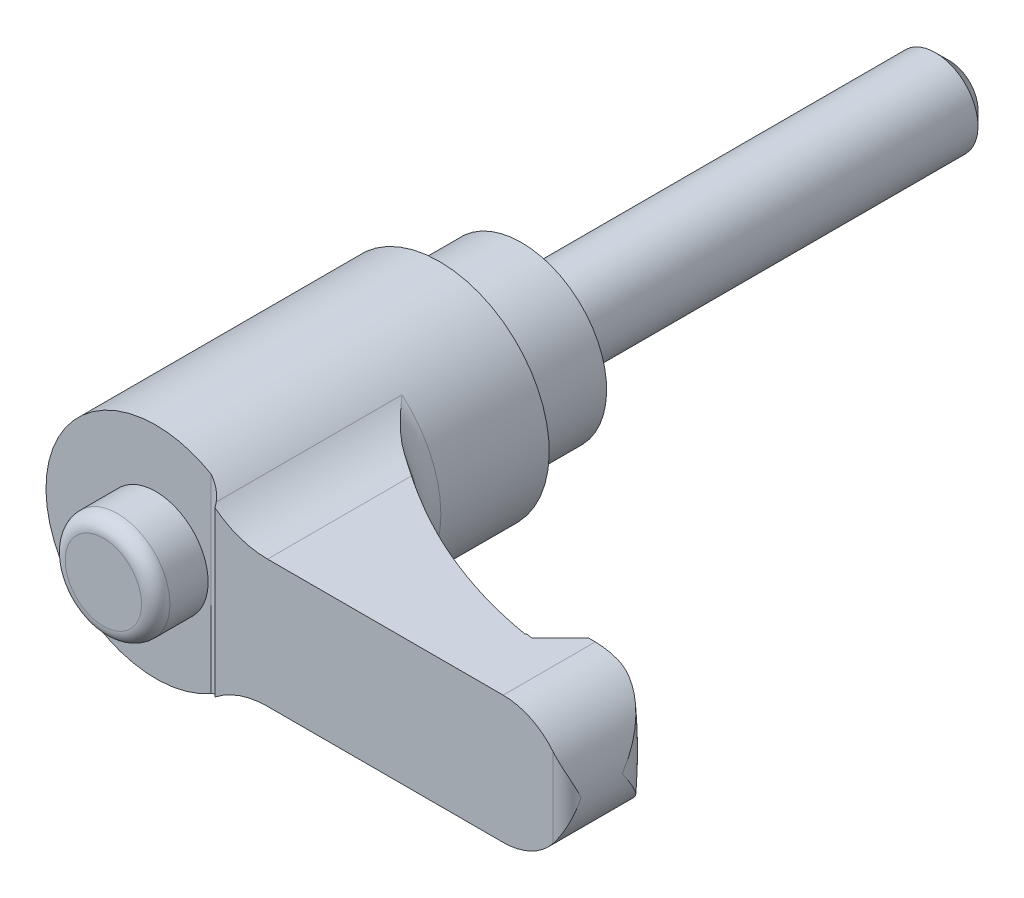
ISO-10303-21;
HEADER;
FILE_DESCRIPTION(('STEP AP214'),'2;1');
FILE_NAME('part.step','',(''),(''),'','','');
FILE_SCHEMA(('AUTOMOTIVE_DESIGN { 1 0 10303 214 1 1 1 1 }'));
ENDSEC;
DATA;
#1=APPLICATION_CONTEXT('core data for automotive mechanical design processes');
#2=APPLICATION_PROTOCOL_DEFINITION('international standard','automotive_design',2000,#1);
#3=PRODUCT_CONTEXT('',#1,'mechanical');
#4=PRODUCT('Part','Part','',(#3));
#5=PRODUCT_RELATED_PRODUCT_CATEGORY('part','',(#4));
#6=PRODUCT_DEFINITION_FORMATION('','',#4);
#7=PRODUCT_DEFINITION_CONTEXT('part definition',#1,'design');
#8=PRODUCT_DEFINITION('design','',#6,#7);
#9=PRODUCT_DEFINITION_SHAPE('','',#8);
#10=(LENGTH_UNIT() NAMED_UNIT(*) SI_UNIT(.MILLI.,.METRE.));
#11=(NAMED_UNIT(*) PLANE_ANGLE_UNIT() SI_UNIT($,.RADIAN.));
#12=(NAMED_UNIT(*) SI_UNIT($,.STERADIAN.) SOLID_ANGLE_UNIT());
#13=UNCERTAINTY_MEASURE_WITH_UNIT(LENGTH_MEASURE(1.E-05),#10,'distance_accuracy_value','');
#14=(GEOMETRIC_REPRESENTATION_CONTEXT(3) GLOBAL_UNCERTAINTY_ASSIGNED_CONTEXT((#13)) GLOBAL_UNIT_ASSIGNED_CONTEXT((#10,
#11,#12)) REPRESENTATION_CONTEXT('',''));
#15=CARTESIAN_POINT('',(0.,0.,0.));
#16=DIRECTION('',(0.,0.,1.));
#17=DIRECTION('',(1.,0.,0.));
#18=AXIS2_PLACEMENT_3D('',#15,#16,#17);
#19=CARTESIAN_POINT('',(4.8,0.,0.));
#20=DIRECTION('',(0.,0.,1.));
#21=DIRECTION('',(0.,-1.,0.));
#22=AXIS2_PLACEMENT_3D('',#19,#20,#21);
#23=PLANE('',#22);
#24=CARTESIAN_POINT('',(0.,0.,0.));
#25=DIRECTION('',(0.,0.,-1.));
#26=DIRECTION('',(0.,1.,0.));
#27=AXIS2_PLACEMENT_3D('',#24,#25,#26);
#28=CIRCLE('',#27,3.);
#29=CARTESIAN_POINT('',(0.,3.,0.));
#30=VERTEX_POINT('',#29);
#31=EDGE_CURVE('E493',#30,#30,#28,.T.);
#32=ORIENTED_EDGE('',*,*,#31,.F.);
#33=EDGE_LOOP('',(#32));
#34=FACE_BOUND('',#33,.T.);
#35=CARTESIAN_POINT('',(0.,0.,0.));
#36=DIRECTION('',(0.,0.,-1.));
#37=DIRECTION('',(0.,1.,0.));
#38=AXIS2_PLACEMENT_3D('',#35,#36,#37);
#39=CIRCLE('',#38,4.8);
#40=CARTESIAN_POINT('',(0.,4.8,0.));
#41=VERTEX_POINT('',#40);
#42=EDGE_CURVE('E433',#41,#41,#39,.T.);
#43=ORIENTED_EDGE('',*,*,#42,.T.);
#44=EDGE_LOOP('',(#43));
#45=FACE_BOUND('',#44,.T.);
#46=ADVANCED_FACE('F14',(#34,#45),#23,.F.);
#47=CARTESIAN_POINT('',(0.,0.,26.));
#48=DIRECTION('',(0.,0.,-1.));
#49=DIRECTION('',(0.,1.,0.));
#50=AXIS2_PLACEMENT_3D('',#47,#48,#49);
#51=PLANE('',#50);
#52=CARTESIAN_POINT('',(0.,0.,26.));
#53=DIRECTION('',(0.,0.,-1.));
#54=DIRECTION('',(0.,1.,0.));
#55=AXIS2_PLACEMENT_3D('',#52,#53,#54);
#56=CIRCLE('',#55,7.75);
#57=CARTESIAN_POINT('',(3.875,-6.7116968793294,26.));
#58=VERTEX_POINT('',#57);
#59=CARTESIAN_POINT('',(3.875,6.7116968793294,26.));
#60=VERTEX_POINT('',#59);
#61=EDGE_CURVE('E380',#58,#60,#56,.T.);
#62=ORIENTED_EDGE('',*,*,#61,.F.);
#63=DIRECTION('',(0.,1.,0.));
#64=VECTOR('',#63,1.);
#65=CARTESIAN_POINT('',(3.875,-9.,26.));
#66=LINE('',#65,#64);
#67=EDGE_CURVE('E467',#58,#60,#66,.T.);
#68=ORIENTED_EDGE('',*,*,#67,.T.);
#69=EDGE_LOOP('',(#62,#68));
#70=FACE_BOUND('',#69,.T.);
#71=CARTESIAN_POINT('',(0.,0.,26.));
#72=DIRECTION('',(0.,0.,-1.));
#73=DIRECTION('',(0.,1.,0.));
#74=AXIS2_PLACEMENT_3D('',#71,#72,#73);
#75=CIRCLE('',#74,3.69047619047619);
#76=CARTESIAN_POINT('',(0.,3.69047619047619,26.));
#77=VERTEX_POINT('',#76);
#78=EDGE_CURVE('E188',#77,#77,#75,.F.);
#79=ORIENTED_EDGE('',*,*,#78,.F.);
#80=EDGE_LOOP('',(#79));
#81=FACE_BOUND('',#80,.T.);
#82=ADVANCED_FACE('F163',(#70,#81),#51,.F.);
#83=CARTESIAN_POINT('',(25.5,0.,0.));
#84=DIRECTION('',(0.,0.,1.));
#85=DIRECTION('',(0.,-1.,0.));
#86=AXIS2_PLACEMENT_3D('',#83,#84,#85);
#87=CYLINDRICAL_SURFACE('',#86,4.5);
#88=CARTESIAN_POINT('',(30.,0.,23.1));
#89=CARTESIAN_POINT('',(30.0000000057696,-0.00397224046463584,23.0972162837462));
#90=CARTESIAN_POINT('',(29.9999947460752,-0.00794462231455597,23.0944324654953));
#91=CARTESIAN_POINT('',(29.9991779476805,-0.316207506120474,22.8784039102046));
#92=CARTESIAN_POINT('',(29.967472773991,-0.621260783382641,22.6646232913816));
#93=CARTESIAN_POINT('',(29.8729566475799,-1.07288244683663,22.3499400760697));
#94=CARTESIAN_POINT('',(29.8335087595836,-1.2227001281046,22.2458576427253));
#95=CARTESIAN_POINT('',(29.7386099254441,-1.51933949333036,22.0407893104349));
#96=CARTESIAN_POINT('',(29.6831664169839,-1.6661625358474,21.9398019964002));
#97=CARTESIAN_POINT('',(29.5225221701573,-2.0316181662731,21.690355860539));
#98=CARTESIAN_POINT('',(29.4064726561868,-2.24755940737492,21.5447545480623));
#99=CARTESIAN_POINT('',(29.1349908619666,-2.66429651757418,21.2699985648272));
#100=CARTESIAN_POINT('',(28.9796468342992,-2.86512503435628,21.1408080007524));
#101=CARTESIAN_POINT('',(28.6740094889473,-3.19567948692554,20.9378778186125));
#102=CARTESIAN_POINT('',(28.5328529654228,-3.3303385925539,20.8584463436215));
#103=CARTESIAN_POINT('',(28.2285136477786,-3.58389708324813,20.7186599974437));
#104=CARTESIAN_POINT('',(28.0653563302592,-3.70281438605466,20.6582833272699));
#105=CARTESIAN_POINT('',(27.7569268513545,-3.89637158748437,20.5739705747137));
#106=CARTESIAN_POINT('',(27.6155988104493,-3.97499958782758,20.5449430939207));
#107=CARTESIAN_POINT('',(27.3962983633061,-4.08175109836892,20.516319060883));
#108=CARTESIAN_POINT('',(27.3219652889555,-4.11547521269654,20.5092639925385));
#109=CARTESIAN_POINT('',(27.1713145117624,-4.17892025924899,20.5006475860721));
#110=CARTESIAN_POINT('',(27.0949977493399,-4.20864304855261,20.4990836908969));
#111=CARTESIAN_POINT('',(26.940135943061,-4.26413478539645,20.5019689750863));
#112=CARTESIAN_POINT('',(26.8615759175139,-4.28985895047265,20.5064814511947));
#113=CARTESIAN_POINT('',(26.7037978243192,-4.33677756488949,20.5220962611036));
#114=CARTESIAN_POINT('',(26.624580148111,-4.35797453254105,20.5331949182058));
#115=CARTESIAN_POINT('',(26.4663684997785,-4.39576374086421,20.5623470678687));
#116=CARTESIAN_POINT('',(26.3873744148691,-4.41235899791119,20.5803959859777));
#117=CARTESIAN_POINT('',(26.230581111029,-4.44101436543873,20.6236628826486));
#118=CARTESIAN_POINT('',(26.1527814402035,-4.4530762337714,20.6488780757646));
#119=CARTESIAN_POINT('',(25.9747863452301,-4.47604389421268,20.7158088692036));
#120=CARTESIAN_POINT('',(25.8753706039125,-4.48535121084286,20.7602222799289));
#121=CARTESIAN_POINT('',(25.7308199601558,-4.4943380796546,20.836059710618));
#122=CARTESIAN_POINT('',(25.6833620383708,-4.49650441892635,20.8629005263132));
#123=CARTESIAN_POINT('',(25.5902043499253,-4.4993369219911,20.9195771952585));
#124=CARTESIAN_POINT('',(25.5445050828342,-4.50000266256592,20.9494138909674));
#125=CARTESIAN_POINT('',(25.4998,-4.49999999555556,20.980704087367));
#126=B_SPLINE_CURVE_WITH_KNOTS('',3,(#88,#89,#90,#91,#92,#93,#94,#95,#96,#97,#98,#99,#100,#101,
#102,#103,#104,#105,#106,#107,#108,#109,#110,#111,#112,#113,#114,#115,#116,#117,#118,#119,#120,
#121,#122,#123,#124,#125),.UNSPECIFIED.,.F.,.F.,(4,2,2,2,2,2,2,2,2,2,2,2,2,2,2,2,2,2,4),(0.,
0.0145521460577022,1.12923174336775,1.68863416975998,2.24777690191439,3.0999476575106,
3.95022123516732,4.58000022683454,5.20905610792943,5.69992949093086,5.94545977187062,
6.19087570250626,6.43886797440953,6.68672193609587,6.93441304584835,7.18200801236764,
7.50864895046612,7.67223429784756,7.83586577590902),.UNSPECIFIED.);
#127=CARTESIAN_POINT('',(27.0737254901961,-4.21584962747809,20.5));
#128=VERTEX_POINT('',#127);
#129=CARTESIAN_POINT('',(30.,0.,23.1));
#130=VERTEX_POINT('',#129);
#131=EDGE_CURVE('E133',#128,#130,#126,.F.);
#132=ORIENTED_EDGE('',*,*,#131,.T.);
#133=CARTESIAN_POINT('',(30.,0.,23.1));
#134=CARTESIAN_POINT('',(30.0000000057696,0.00397224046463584,23.0972162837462));
#135=CARTESIAN_POINT('',(29.9999947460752,0.00794462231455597,23.0944324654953));
#136=CARTESIAN_POINT('',(29.9991779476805,0.316207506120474,22.8784039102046));
#137=CARTESIAN_POINT('',(29.967472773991,0.621260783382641,22.6646232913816));
#138=CARTESIAN_POINT('',(29.8729566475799,1.07288244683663,22.3499400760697));
#139=CARTESIAN_POINT('',(29.8335087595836,1.2227001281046,22.2458576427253));
#140=CARTESIAN_POINT('',(29.7386099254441,1.51933949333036,22.0407893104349));
#141=CARTESIAN_POINT('',(29.6831664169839,1.6661625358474,21.9398019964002));
#142=CARTESIAN_POINT('',(29.5225221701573,2.0316181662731,21.690355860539));
#143=CARTESIAN_POINT('',(29.4064726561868,2.24755940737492,21.5447545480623));
#144=CARTESIAN_POINT('',(29.1349908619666,2.66429651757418,21.2699985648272));
#145=CARTESIAN_POINT('',(28.9796468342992,2.86512503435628,21.1408080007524));
#146=CARTESIAN_POINT('',(28.6740094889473,3.19567948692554,20.9378778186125));
#147=CARTESIAN_POINT('',(28.5328529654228,3.3303385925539,20.8584463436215));
#148=CARTESIAN_POINT('',(28.2285136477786,3.58389708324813,20.7186599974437));
#149=CARTESIAN_POINT('',(28.0653563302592,3.70281438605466,20.6582833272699));
#150=CARTESIAN_POINT('',(27.7569268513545,3.89637158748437,20.5739705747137));
#151=CARTESIAN_POINT('',(27.6155988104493,3.97499958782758,20.5449430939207));
#152=CARTESIAN_POINT('',(27.3962983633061,4.08175109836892,20.516319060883));
#153=CARTESIAN_POINT('',(27.3219652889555,4.11547521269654,20.5092639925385));
#154=CARTESIAN_POINT('',(27.1713145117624,4.17892025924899,20.5006475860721));
#155=CARTESIAN_POINT('',(27.0949977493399,4.20864304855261,20.4990836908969));
#156=CARTESIAN_POINT('',(26.940135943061,4.26413478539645,20.5019689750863));
#157=CARTESIAN_POINT('',(26.8615759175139,4.28985895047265,20.5064814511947));
#158=CARTESIAN_POINT('',(26.7037978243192,4.33677756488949,20.5220962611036));
#159=CARTESIAN_POINT('',(26.624580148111,4.35797453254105,20.5331949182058));
#160=CARTESIAN_POINT('',(26.4663684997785,4.39576374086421,20.5623470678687));
#161=CARTESIAN_POINT('',(26.3873744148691,4.41235899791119,20.5803959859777));
#162=CARTESIAN_POINT('',(26.230581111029,4.44101436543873,20.6236628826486));
#163=CARTESIAN_POINT('',(26.1527814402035,4.4530762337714,20.6488780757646));
#164=CARTESIAN_POINT('',(25.9747863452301,4.47604389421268,20.7158088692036));
#165=CARTESIAN_POINT('',(25.8753706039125,4.48535121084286,20.7602222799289));
#166=CARTESIAN_POINT('',(25.7308199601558,4.4943380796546,20.836059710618));
#167=CARTESIAN_POINT('',(25.6833620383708,4.49650441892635,20.8629005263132));
#168=CARTESIAN_POINT('',(25.5902043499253,4.4993369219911,20.9195771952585));
#169=CARTESIAN_POINT('',(25.5445050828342,4.50000266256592,20.9494138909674));
#170=CARTESIAN_POINT('',(25.4998,4.49999999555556,20.980704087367));
#171=B_SPLINE_CURVE_WITH_KNOTS('',3,(#133,#134,#135,#136,#137,#138,#139,#140,#141,#142,#143,
#144,#145,#146,#147,#148,#149,#150,#151,#152,#153,#154,#155,#156,#157,#158,#159,#160,#161,#162,
#163,#164,#165,#166,#167,#168,#169,#170),.UNSPECIFIED.,.F.,.F.,(4,2,2,2,2,2,2,2,2,2,2,2,2,2,2,2,
2,2,4),(0.,0.0145521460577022,1.12923174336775,1.68863416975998,2.24777690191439,
3.0999476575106,3.95022123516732,4.58000022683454,5.20905610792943,5.69992949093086,
5.94545977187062,6.19087570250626,6.43886797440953,6.68672193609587,6.93441304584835,
7.18200801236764,7.50864895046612,7.67223429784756,7.83586577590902),.UNSPECIFIED.);
#172=CARTESIAN_POINT('',(27.0737254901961,4.21584962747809,20.5));
#173=VERTEX_POINT('',#172);
#174=EDGE_CURVE('E130',#130,#173,#171,.T.);
#175=ORIENTED_EDGE('',*,*,#174,.T.);
#176=CARTESIAN_POINT('',(25.5,0.,20.5));
#177=DIRECTION('',(0.,0.,-1.));
#178=DIRECTION('',(0.,1.,0.));
#179=AXIS2_PLACEMENT_3D('',#176,#177,#178);
#180=CIRCLE('',#179,4.5);
#181=CARTESIAN_POINT('',(25.5,4.5,20.5));
#182=VERTEX_POINT('',#181);
#183=EDGE_CURVE('E405',#173,#182,#180,.F.);
#184=ORIENTED_EDGE('',*,*,#183,.T.);
#185=DIRECTION('',(0.,0.,1.));
#186=VECTOR('',#185,1.);
#187=CARTESIAN_POINT('',(25.5,4.5,0.));
#188=LINE('',#187,#186);
#189=CARTESIAN_POINT('',(25.5,4.5,27.));
#190=VERTEX_POINT('',#189);
#191=EDGE_CURVE('E404',#182,#190,#188,.T.);
#192=ORIENTED_EDGE('',*,*,#191,.T.);
#193=CARTESIAN_POINT('',(25.5,0.,27.));
#194=DIRECTION('',(0.,0.,1.));
#195=DIRECTION('',(0.,-1.,0.));
#196=AXIS2_PLACEMENT_3D('',#193,#194,#195);
#197=CIRCLE('',#196,4.5);
#198=CARTESIAN_POINT('',(29.,2.82842712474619,27.));
#199=VERTEX_POINT('',#198);
#200=EDGE_CURVE('E383',#199,#190,#197,.T.);
#201=ORIENTED_EDGE('',*,*,#200,.F.);
#202=CARTESIAN_POINT('',(29.,2.82842712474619,27.));
#203=CARTESIAN_POINT('',(29.0452569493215,2.77244060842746,26.9999705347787));
#204=CARTESIAN_POINT('',(29.08910814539,2.71541373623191,26.9969310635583));
#205=CARTESIAN_POINT('',(29.1737346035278,2.59976408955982,26.9857221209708));
#206=CARTESIAN_POINT('',(29.2145155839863,2.54114457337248,26.9775624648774));
#207=CARTESIAN_POINT('',(29.2926216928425,2.42301598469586,26.9570723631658));
#208=CARTESIAN_POINT('',(29.3299701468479,2.36351669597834,26.9447732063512));
#209=CARTESIAN_POINT('',(29.4015263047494,2.24343051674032,26.9166544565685));
#210=CARTESIAN_POINT('',(29.4357319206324,2.18284293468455,26.9008325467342));
#211=CARTESIAN_POINT('',(29.5205149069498,2.0242761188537,26.8558925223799));
#212=CARTESIAN_POINT('',(29.5686353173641,1.92562477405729,26.8244847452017));
#213=CARTESIAN_POINT('',(29.6569408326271,1.7267576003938,26.7560098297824));
#214=CARTESIAN_POINT('',(29.6971228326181,1.62654117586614,26.7189404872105));
#215=CARTESIAN_POINT('',(29.769924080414,1.42454335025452,26.6403878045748));
#216=CARTESIAN_POINT('',(29.8025090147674,1.32275698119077,26.5988856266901));
#217=CARTESIAN_POINT('',(29.8600923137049,1.1184186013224,26.5127603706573));
#218=CARTESIAN_POINT('',(29.8850925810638,1.0158667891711,26.4681380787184));
#219=CARTESIAN_POINT('',(29.9373931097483,0.763467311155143,26.3559210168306));
#220=CARTESIAN_POINT('',(29.9605764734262,0.613303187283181,26.2871011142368));
#221=CARTESIAN_POINT('',(29.9916507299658,0.312779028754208,26.1474204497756));
#222=CARTESIAN_POINT('',(29.999578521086,0.162420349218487,26.0765650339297));
#223=CARTESIAN_POINT('',(29.9999945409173,0.00809034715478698,26.0038138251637));
#224=CARTESIAN_POINT('',(29.999999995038,0.00404514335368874,26.0019068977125));
#225=CARTESIAN_POINT('',(30.,0.,26.));
#226=B_SPLINE_CURVE_WITH_KNOTS('',3,(#202,#203,#204,#205,#206,#207,#208,#209,#210,#211,#212,
#213,#214,#215,#216,#217,#218,#219,#220,#221,#222,#223,#224,#225),.UNSPECIFIED.,.F.,.F.,(4,2,2,
2,2,2,2,2,2,2,2,4),(0.,0.215782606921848,0.431152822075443,0.644930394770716,0.858848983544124,
1.20082332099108,1.5429311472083,1.88655545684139,2.23009348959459,2.7297347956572,
3.22816610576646,3.2415825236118),.UNSPECIFIED.);
#227=CARTESIAN_POINT('',(30.,0.,26.));
#228=VERTEX_POINT('',#227);
#229=EDGE_CURVE('E174',#228,#199,#226,.F.);
#230=ORIENTED_EDGE('',*,*,#229,.F.);
#231=CARTESIAN_POINT('',(29.,-2.82842712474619,27.));
#232=CARTESIAN_POINT('',(29.0452569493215,-2.77244060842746,26.9999705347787));
#233=CARTESIAN_POINT('',(29.08910814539,-2.71541373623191,26.9969310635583));
#234=CARTESIAN_POINT('',(29.1737346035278,-2.59976408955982,26.9857221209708));
#235=CARTESIAN_POINT('',(29.2145155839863,-2.54114457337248,26.9775624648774));
#236=CARTESIAN_POINT('',(29.2926216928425,-2.42301598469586,26.9570723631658));
#237=CARTESIAN_POINT('',(29.3299701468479,-2.36351669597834,26.9447732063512));
#238=CARTESIAN_POINT('',(29.4015263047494,-2.24343051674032,26.9166544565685));
#239=CARTESIAN_POINT('',(29.4357319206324,-2.18284293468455,26.9008325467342));
#240=CARTESIAN_POINT('',(29.5205149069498,-2.0242761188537,26.8558925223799));
#241=CARTESIAN_POINT('',(29.5686353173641,-1.92562477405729,26.8244847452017));
#242=CARTESIAN_POINT('',(29.6569408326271,-1.7267576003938,26.7560098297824));
#243=CARTESIAN_POINT('',(29.6971228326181,-1.62654117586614,26.7189404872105));
#244=CARTESIAN_POINT('',(29.769924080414,-1.42454335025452,26.6403878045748));
#245=CARTESIAN_POINT('',(29.8025090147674,-1.32275698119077,26.5988856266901));
#246=CARTESIAN_POINT('',(29.8600923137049,-1.1184186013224,26.5127603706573));
#247=CARTESIAN_POINT('',(29.8850925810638,-1.0158667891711,26.4681380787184));
#248=CARTESIAN_POINT('',(29.9373931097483,-0.763467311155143,26.3559210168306));
#249=CARTESIAN_POINT('',(29.9605764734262,-0.613303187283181,26.2871011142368));
#250=CARTESIAN_POINT('',(29.9916507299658,-0.312779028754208,26.1474204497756));
#251=CARTESIAN_POINT('',(29.999578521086,-0.162420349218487,26.0765650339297));
#252=CARTESIAN_POINT('',(29.9999945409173,-0.00809034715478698,26.0038138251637));
#253=CARTESIAN_POINT('',(29.999999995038,-0.00404514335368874,26.0019068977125));
#254=CARTESIAN_POINT('',(30.,0.,26.));
#255=B_SPLINE_CURVE_WITH_KNOTS('',3,(#231,#232,#233,#234,#235,#236,#237,#238,#239,#240,#241,
#242,#243,#244,#245,#246,#247,#248,#249,#250,#251,#252,#253,#254),.UNSPECIFIED.,.F.,.F.,(4,2,2,
2,2,2,2,2,2,2,2,4),(0.,0.215782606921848,0.431152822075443,0.644930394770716,0.858848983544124,
1.20082332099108,1.5429311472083,1.88655545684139,2.23009348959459,2.7297347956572,
3.22816610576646,3.2415825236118),.UNSPECIFIED.);
#256=CARTESIAN_POINT('',(29.,-2.82842712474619,27.));
#257=VERTEX_POINT('',#256);
#258=EDGE_CURVE('E182',#257,#228,#255,.T.);
#259=ORIENTED_EDGE('',*,*,#258,.F.);
#260=CARTESIAN_POINT('',(25.5,-4.5,27.));
#261=VERTEX_POINT('',#260);
#262=EDGE_CURVE('E389',#261,#257,#197,.T.);
#263=ORIENTED_EDGE('',*,*,#262,.F.);
#264=DIRECTION('',(0.,0.,1.));
#265=VECTOR('',#264,1.);
#266=CARTESIAN_POINT('',(25.5,-4.5,0.));
#267=LINE('',#266,#265);
#268=CARTESIAN_POINT('',(25.5,-4.5,20.5));
#269=VERTEX_POINT('',#268);
#270=EDGE_CURVE('E409',#269,#261,#267,.T.);
#271=ORIENTED_EDGE('',*,*,#270,.F.);
#272=EDGE_CURVE('E140',#269,#128,#180,.F.);
#273=ORIENTED_EDGE('',*,*,#272,.T.);
#274=EDGE_LOOP('',(#132,#175,#184,#192,#201,#230,#259,#263,#271,#273));
#275=FACE_BOUND('',#274,.T.);
#276=ADVANCED_FACE('F138',(#275),#87,.T.);
#277=CARTESIAN_POINT('',(28.072410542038,-9.,-7.06806810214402));
#278=DIRECTION('',(0.,1.,0.));
#279=DIRECTION('',(-1.,0.,0.));
#280=AXIS2_PLACEMENT_3D('',#277,#278,#279);
#281=CYLINDRICAL_SURFACE('',#280,30.);
#282=CARTESIAN_POINT('',(22.457864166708,5.40076351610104,22.4018635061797));
#283=CARTESIAN_POINT('',(22.5328704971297,5.02783315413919,22.4161416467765));
#284=CARTESIAN_POINT('',(22.6003478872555,4.65331694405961,22.4287120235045));
#285=CARTESIAN_POINT('',(22.7199001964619,3.90172149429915,22.4506465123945));
#286=CARTESIAN_POINT('',(22.7719742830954,3.52464211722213,22.4600104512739));
#287=CARTESIAN_POINT('',(22.860391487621,2.76836181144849,22.4757441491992));
#288=CARTESIAN_POINT('',(22.8967259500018,2.38915983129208,22.4821122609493));
#289=CARTESIAN_POINT('',(22.953399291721,1.62955869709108,22.4919810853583));
#290=CARTESIAN_POINT('',(22.9737386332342,1.24915957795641,22.4954818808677));
#291=CARTESIAN_POINT('',(23.0101209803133,0.119914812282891,22.5017516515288));
#292=CARTESIAN_POINT('',(23.0030278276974,-0.62982701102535,22.5005458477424));
#293=CARTESIAN_POINT('',(22.9265280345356,-2.12549757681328,22.487326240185));
#294=CARTESIAN_POINT('',(22.8571649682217,-2.87142861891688,22.4753199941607));
#295=CARTESIAN_POINT('',(22.717445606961,-3.91200869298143,22.450161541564));
#296=CARTESIAN_POINT('',(22.6723784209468,-4.21035002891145,22.4419679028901));
#297=CARTESIAN_POINT('',(22.5724363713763,-4.80637536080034,22.4235048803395));
#298=CARTESIAN_POINT('',(22.5175283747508,-5.10405358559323,22.4132284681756));
#299=CARTESIAN_POINT('',(22.457864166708,-5.40076351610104,22.4018635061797));
#300=B_SPLINE_CURVE_WITH_KNOTS('',3,(#282,#283,#284,#285,#286,#287,#288,#289,#290,#291,#292,
#293,#294,#295,#296,#297,#298,#299),.UNSPECIFIED.,.F.,.F.,(4,2,2,2,2,2,2,2,4),(0.,
1.14192528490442,2.28391227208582,3.4265264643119,4.56910763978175,6.81558260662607,
9.06048679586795,9.96586555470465,10.8743519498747),.UNSPECIFIED.);
#301=CARTESIAN_POINT('',(23.,0.,22.5));
#302=VERTEX_POINT('',#301);
#303=CARTESIAN_POINT('',(22.6238084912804,-4.5,22.4329951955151));
#304=VERTEX_POINT('',#303);
#305=EDGE_CURVE('E136',#302,#304,#300,.T.);
#306=ORIENTED_EDGE('',*,*,#305,.F.);
#307=DIRECTION('',(0.,1.,0.));
#308=VECTOR('',#307,1.);
#309=CARTESIAN_POINT('',(23.,-9.,22.5));
#310=LINE('',#309,#308);
#311=CARTESIAN_POINT('',(23.,-4.5,22.5));
#312=VERTEX_POINT('',#311);
#313=EDGE_CURVE('E473',#312,#302,#310,.T.);
#314=ORIENTED_EDGE('',*,*,#313,.F.);
#315=CARTESIAN_POINT('',(28.072410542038,-4.5,-7.06806810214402));
#316=DIRECTION('',(0.,1.,0.));
#317=DIRECTION('',(-1.,0.,0.));
#318=AXIS2_PLACEMENT_3D('',#315,#316,#317);
#319=CIRCLE('',#318,30.);
#320=EDGE_CURVE('E464',#312,#304,#319,.F.);
#321=ORIENTED_EDGE('',*,*,#320,.T.);
#322=EDGE_LOOP('',(#306,#314,#321));
#323=FACE_BOUND('',#322,.T.);
#324=ADVANCED_FACE('F162',(#323),#281,.F.);
#325=CARTESIAN_POINT('',(27.4,-9.,20.5));
#326=DIRECTION('',(0.,0.,-1.));
#327=DIRECTION('',(0.,1.,0.));
#328=AXIS2_PLACEMENT_3D('',#325,#326,#327);
#329=PLANE('',#328);
#330=ORIENTED_EDGE('',*,*,#183,.F.);
#331=CARTESIAN_POINT('',(0.,0.,20.5));
#332=DIRECTION('',(0.,0.,-1.));
#333=DIRECTION('',(0.,1.,0.));
#334=AXIS2_PLACEMENT_3D('',#331,#332,#333);
#335=CIRCLE('',#334,27.4);
#336=EDGE_CURVE('E37',#173,#128,#335,.T.);
#337=ORIENTED_EDGE('',*,*,#336,.T.);
#338=ORIENTED_EDGE('',*,*,#272,.F.);
#339=DIRECTION('',(-1.,0.,0.));
#340=VECTOR('',#339,1.);
#341=CARTESIAN_POINT('',(25.5,-4.5,20.5));
#342=LINE('',#341,#340);
#343=CARTESIAN_POINT('',(25.,-4.5,20.5));
#344=VERTEX_POINT('',#343);
#345=EDGE_CURVE('E540',#269,#344,#342,.T.);
#346=ORIENTED_EDGE('',*,*,#345,.T.);
#347=DIRECTION('',(0.,1.,0.));
#348=VECTOR('',#347,1.);
#349=CARTESIAN_POINT('',(25.,-9.,20.5));
#350=LINE('',#349,#348);
#351=CARTESIAN_POINT('',(25.,4.5,20.5));
#352=VERTEX_POINT('',#351);
#353=EDGE_CURVE('E460',#344,#352,#350,.T.);
#354=ORIENTED_EDGE('',*,*,#353,.T.);
#355=DIRECTION('',(1.,0.,0.));
#356=VECTOR('',#355,1.);
#357=CARTESIAN_POINT('',(8.87764045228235,4.5,20.5));
#358=LINE('',#357,#356);
#359=EDGE_CURVE('E419',#352,#182,#358,.T.);
#360=ORIENTED_EDGE('',*,*,#359,.T.);
#361=EDGE_LOOP('',(#330,#337,#338,#346,#354,#360));
#362=FACE_BOUND('',#361,.T.);
#363=ADVANCED_FACE('F196',(#362),#329,.T.);
#364=CARTESIAN_POINT('',(0.,0.,27.));
#365=DIRECTION('',(0.,0.,1.));
#366=DIRECTION('',(0.,-1.,0.));
#367=AXIS2_PLACEMENT_3D('',#364,#365,#366);
#368=PLANE('',#367);
#369=CARTESIAN_POINT('',(8.87764045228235,10.5,27.));
#370=DIRECTION('',(0.,0.,1.));
#371=DIRECTION('',(1.,0.,0.));
#372=AXIS2_PLACEMENT_3D('',#369,#370,#371);
#373=CIRCLE('',#372,6.);
#374=CARTESIAN_POINT('',(5.16666666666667,5.78527057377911,27.));
#375=VERTEX_POINT('',#374);
#376=CARTESIAN_POINT('',(8.87764045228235,4.5,27.));
#377=VERTEX_POINT('',#376);
#378=EDGE_CURVE('E414',#375,#377,#373,.T.);
#379=ORIENTED_EDGE('',*,*,#378,.F.);
#380=DIRECTION('',(0.,1.,0.));
#381=VECTOR('',#380,1.);
#382=CARTESIAN_POINT('',(5.16666666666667,-9.,27.));
#383=LINE('',#382,#381);
#384=CARTESIAN_POINT('',(5.16666666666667,-5.78527057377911,27.));
#385=VERTEX_POINT('',#384);
#386=EDGE_CURVE('E453',#385,#375,#383,.T.);
#387=ORIENTED_EDGE('',*,*,#386,.F.);
#388=CARTESIAN_POINT('',(8.87764045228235,-10.5,27.));
#389=DIRECTION('',(0.,0.,1.));
#390=DIRECTION('',(1.,0.,0.));
#391=AXIS2_PLACEMENT_3D('',#388,#389,#390);
#392=CIRCLE('',#391,6.);
#393=CARTESIAN_POINT('',(8.87764045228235,-4.5,27.));
#394=VERTEX_POINT('',#393);
#395=EDGE_CURVE('E417',#394,#385,#392,.T.);
#396=ORIENTED_EDGE('',*,*,#395,.F.);
#397=DIRECTION('',(-1.,0.,0.));
#398=VECTOR('',#397,1.);
#399=CARTESIAN_POINT('',(25.5,-4.5,27.));
#400=LINE('',#399,#398);
#401=EDGE_CURVE('E413',#261,#394,#400,.T.);
#402=ORIENTED_EDGE('',*,*,#401,.F.);
#403=ORIENTED_EDGE('',*,*,#262,.T.);
#404=DIRECTION('',(0.,1.,0.));
#405=VECTOR('',#404,1.);
#406=CARTESIAN_POINT('',(29.,-9.,27.));
#407=LINE('',#406,#405);
#408=EDGE_CURVE('E401',#257,#199,#407,.T.);
#409=ORIENTED_EDGE('',*,*,#408,.T.);
#410=ORIENTED_EDGE('',*,*,#200,.T.);
#411=DIRECTION('',(1.,0.,0.));
#412=VECTOR('',#411,1.);
#413=CARTESIAN_POINT('',(8.87764045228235,4.5,27.));
#414=LINE('',#413,#412);
#415=EDGE_CURVE('E400',#377,#190,#414,.T.);
#416=ORIENTED_EDGE('',*,*,#415,.F.);
#417=EDGE_LOOP('',(#379,#387,#396,#402,#403,#409,#410,#416));
#418=FACE_BOUND('',#417,.T.);
#419=ADVANCED_FACE('F244',(#418),#368,.T.);
#420=CARTESIAN_POINT('',(0.,0.,0.));
#421=DIRECTION('',(0.,0.,-1.));
#422=DIRECTION('',(0.,1.,0.));
#423=AXIS2_PLACEMENT_3D('',#420,#421,#422);
#424=CYLINDRICAL_SURFACE('',#423,7.75);
#425=CARTESIAN_POINT('',(0.,0.,13.6426560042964));
#426=DIRECTION('',(0.,0.,-1.));
#427=DIRECTION('',(0.,1.,0.));
#428=AXIS2_PLACEMENT_3D('',#425,#426,#427);
#429=CIRCLE('',#428,7.75);
#430=CARTESIAN_POINT('',(5.00376098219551,5.91818181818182,13.6426560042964));
#431=VERTEX_POINT('',#430);
#432=CARTESIAN_POINT('',(5.00376098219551,-5.91818181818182,13.6426560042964));
#433=VERTEX_POINT('',#432);
#434=EDGE_CURVE('E374',#431,#433,#429,.T.);
#435=ORIENTED_EDGE('',*,*,#434,.T.);
#436=DIRECTION('',(0.,0.,1.));
#437=VECTOR('',#436,1.);
#438=CARTESIAN_POINT('',(5.00376098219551,-5.91818181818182,0.));
#439=LINE('',#438,#437);
#440=CARTESIAN_POINT('',(5.00376098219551,-5.91818181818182,26.7442638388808));
#441=VERTEX_POINT('',#440);
#442=EDGE_CURVE('E425',#433,#441,#439,.T.);
#443=ORIENTED_EDGE('',*,*,#442,.T.);
#444=CARTESIAN_POINT('',(3.875,-6.7116968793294,26.));
#445=CARTESIAN_POINT('',(3.9487248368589,-6.66914880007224,26.0179048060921));
#446=CARTESIAN_POINT('',(4.02097408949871,-6.62579988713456,26.039874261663));
#447=CARTESIAN_POINT('',(4.16199829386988,-6.53812669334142,26.0915573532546));
#448=CARTESIAN_POINT('',(4.23077434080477,-6.49380272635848,26.1212685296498));
#449=CARTESIAN_POINT('',(4.36202505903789,-6.40634475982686,26.1868862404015));
#450=CARTESIAN_POINT('',(4.42463632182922,-6.36322379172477,26.2225378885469));
#451=CARTESIAN_POINT('',(4.54579687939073,-6.27724013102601,26.3004737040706));
#452=CARTESIAN_POINT('',(4.60434578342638,-6.23437746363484,26.3427585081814));
#453=CARTESIAN_POINT('',(4.71026264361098,-6.1546555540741,26.4283893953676));
#454=CARTESIAN_POINT('',(4.75813291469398,-6.11768751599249,26.4710140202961));
#455=CARTESIAN_POINT('',(4.8500303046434,-6.04509175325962,26.56120031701));
#456=CARTESIAN_POINT('',(4.89405965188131,-6.00946325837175,26.6087590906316));
#457=CARTESIAN_POINT('',(4.97925799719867,-5.9390764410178,26.7103994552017));
#458=CARTESIAN_POINT('',(5.02029084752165,-5.90438218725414,26.7646407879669));
#459=CARTESIAN_POINT('',(5.09738332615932,-5.83796295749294,26.8783962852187));
#460=CARTESIAN_POINT('',(5.13343386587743,-5.80624344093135,26.9379197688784));
#461=CARTESIAN_POINT('',(5.16666666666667,-5.77650894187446,27.));
#462=B_SPLINE_CURVE_WITH_KNOTS('',3,(#444,#445,#446,#447,#448,#449,#450,#451,#452,#453,#454,
#455,#456,#457,#458,#459,#460,#461),.UNSPECIFIED.,.F.,.F.,(4,2,2,2,2,2,2,2,4),(0.,
0.260811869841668,0.521540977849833,0.773092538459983,1.02466826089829,1.24638864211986,
1.4679795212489,1.69664297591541,1.92571819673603),.UNSPECIFIED.);
#463=EDGE_CURVE('E218',#58,#441,#462,.T.);
#464=ORIENTED_EDGE('',*,*,#463,.F.);
#465=ORIENTED_EDGE('',*,*,#61,.T.);
#466=CARTESIAN_POINT('',(5.16666666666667,5.77650894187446,27.));
#467=CARTESIAN_POINT('',(5.13714077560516,5.80292379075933,26.9448365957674));
#468=CARTESIAN_POINT('',(5.1053831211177,5.83091583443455,26.8916890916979));
#469=CARTESIAN_POINT('',(5.03785941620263,5.88934998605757,26.7895453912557));
#470=CARTESIAN_POINT('',(5.00209830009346,5.91978906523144,26.7405442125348));
#471=CARTESIAN_POINT('',(4.92700880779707,5.98243056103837,26.646752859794));
#472=CARTESIAN_POINT('',(4.88768622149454,6.01463008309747,26.6019560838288));
#473=CARTESIAN_POINT('',(4.80573825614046,6.08030777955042,26.5165060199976));
#474=CARTESIAN_POINT('',(4.76311181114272,6.11378636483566,26.4758540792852));
#475=CARTESIAN_POINT('',(4.63114473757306,6.21507952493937,26.3605779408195));
#476=CARTESIAN_POINT('',(4.53728284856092,6.28411879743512,26.2920994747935));
#477=CARTESIAN_POINT('',(4.3393749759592,6.42237347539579,26.1724069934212));
#478=CARTESIAN_POINT('',(4.23533663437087,6.49158871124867,26.1211801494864));
#479=CARTESIAN_POINT('',(4.08621326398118,6.5854168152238,26.0632790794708));
#480=CARTESIAN_POINT('',(4.04469277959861,6.61100425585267,26.0487072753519));
#481=CARTESIAN_POINT('',(3.96061680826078,6.66171281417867,26.0222973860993));
#482=CARTESIAN_POINT('',(3.91806319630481,6.68683464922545,26.0104547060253));
#483=CARTESIAN_POINT('',(3.8750000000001,6.7116968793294,26.));
#484=B_SPLINE_CURVE_WITH_KNOTS('',3,(#466,#467,#468,#469,#470,#471,#472,#473,#474,#475,#476,
#477,#478,#479,#480,#481,#482,#483),.UNSPECIFIED.,.F.,.F.,(4,2,2,2,2,2,2,2,4),(0.,
0.203583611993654,0.406919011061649,0.609929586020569,0.813005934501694,1.21684507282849,
1.62038324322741,1.77301957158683,1.9253970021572),.UNSPECIFIED.);
#485=CARTESIAN_POINT('',(5.0037609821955,5.91818181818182,26.7442638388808));
#486=VERTEX_POINT('',#485);
#487=EDGE_CURVE('E232',#486,#60,#484,.T.);
#488=ORIENTED_EDGE('',*,*,#487,.F.);
#489=DIRECTION('',(0.,0.,1.));
#490=VECTOR('',#489,1.);
#491=CARTESIAN_POINT('',(5.00376098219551,5.91818181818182,0.));
#492=LINE('',#491,#490);
#493=EDGE_CURVE('E431',#431,#486,#492,.T.);
#494=ORIENTED_EDGE('',*,*,#493,.F.);
#495=EDGE_LOOP('',(#435,#443,#464,#465,#488,#494));
#496=FACE_BOUND('',#495,.T.);
#497=CARTESIAN_POINT('',(0.,0.,6.));
#498=DIRECTION('',(0.,0.,-1.));
#499=DIRECTION('',(0.,1.,0.));
#500=AXIS2_PLACEMENT_3D('',#497,#498,#499);
#501=CIRCLE('',#500,7.75);
#502=CARTESIAN_POINT('',(0.,7.75,6.));
#503=VERTEX_POINT('',#502);
#504=EDGE_CURVE('E378',#503,#503,#501,.T.);
#505=ORIENTED_EDGE('',*,*,#504,.F.);
#506=EDGE_LOOP('',(#505));
#507=FACE_BOUND('',#506,.T.);
#508=ADVANCED_FACE('F242',(#496,#507),#424,.T.);
#509=CARTESIAN_POINT('',(8.87764045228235,10.5,0.));
#510=DIRECTION('',(0.,0.,1.));
#511=DIRECTION('',(0.,-1.,0.));
#512=AXIS2_PLACEMENT_3D('',#509,#510,#511);
#513=CYLINDRICAL_SURFACE('',#512,6.);
#514=DIRECTION('',(0.,0.,1.));
#515=VECTOR('',#514,1.);
#516=CARTESIAN_POINT('',(8.87764045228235,4.5,0.));
#517=LINE('',#516,#515);
#518=CARTESIAN_POINT('',(8.87764045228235,4.5,16.8419191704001));
#519=VERTEX_POINT('',#518);
#520=EDGE_CURVE('E408',#519,#377,#517,.T.);
#521=ORIENTED_EDGE('',*,*,#520,.F.);
#522=CARTESIAN_POINT('',(8.87784045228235,4.50000000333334,16.8420543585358));
#523=CARTESIAN_POINT('',(8.76298675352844,4.50000678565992,16.7644412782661));
#524=CARTESIAN_POINT('',(8.64795886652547,4.50329006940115,16.687069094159));
#525=CARTESIAN_POINT('',(8.41786670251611,4.51653249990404,16.5336144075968));
#526=CARTESIAN_POINT('',(8.30280331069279,4.52647413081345,16.457529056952));
#527=CARTESIAN_POINT('',(8.07233993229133,4.55315590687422,16.3070362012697));
#528=CARTESIAN_POINT('',(7.95693991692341,4.56989665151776,16.2326288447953));
#529=CARTESIAN_POINT('',(7.72548993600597,4.61048878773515,16.0861329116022));
#530=CARTESIAN_POINT('',(7.60943905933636,4.63435875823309,16.0140509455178));
#531=CARTESIAN_POINT('',(7.49320434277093,4.66190641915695,15.9436475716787));
#532=B_SPLINE_CURVE_WITH_KNOTS('',3,(#522,#523,#524,#525,#526,#527,#528,#529,#530,#531),
.UNSPECIFIED.,.F.,.F.,(4,2,2,2,4),(0.,0.415830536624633,0.830571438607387,1.24534891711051,
1.66121688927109),.UNSPECIFIED.);
#533=CARTESIAN_POINT('',(7.49353468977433,4.66182809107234,15.9438475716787));
#534=VERTEX_POINT('',#533);
#535=EDGE_CURVE('E258',#519,#534,#532,.T.);
#536=ORIENTED_EDGE('',*,*,#535,.T.);
#537=CARTESIAN_POINT('',(7.49386505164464,4.66174977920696,15.9440475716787));
#538=CARTESIAN_POINT('',(7.41534599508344,4.68036361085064,15.8965108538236));
#539=CARTESIAN_POINT('',(7.33813459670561,4.70033346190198,15.8474028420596));
#540=CARTESIAN_POINT('',(7.18628313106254,4.74278447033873,15.7464454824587));
#541=CARTESIAN_POINT('',(7.11164195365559,4.76526452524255,15.694597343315));
#542=CARTESIAN_POINT('',(6.89171782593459,4.83609524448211,15.5357042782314));
#543=CARTESIAN_POINT('',(6.75010221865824,4.88791699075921,15.4251060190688));
#544=CARTESIAN_POINT('',(6.47674906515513,4.99932791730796,15.1976148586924));
#545=CARTESIAN_POINT('',(6.34496293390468,5.05887426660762,15.0807586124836));
#546=CARTESIAN_POINT('',(6.08952700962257,5.18523508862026,14.8421034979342));
#547=CARTESIAN_POINT('',(5.96588083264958,5.25205275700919,14.7203024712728));
#548=CARTESIAN_POINT('',(5.6959472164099,5.41010140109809,14.4425118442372));
#549=CARTESIAN_POINT('',(5.55174299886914,5.50325599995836,14.2855983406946));
#550=CARTESIAN_POINT('',(5.27355500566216,5.70004368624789,13.9693256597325));
#551=CARTESIAN_POINT('',(5.13957057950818,5.80367610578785,13.8099666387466));
#552=CARTESIAN_POINT('',(5.00807252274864,5.91453907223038,13.6479722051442));
#553=CARTESIAN_POINT('',(5.00591610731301,5.91635969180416,13.6453140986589));
#554=CARTESIAN_POINT('',(5.00376098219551,5.91818181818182,13.6426560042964));
#555=B_SPLINE_CURVE_WITH_KNOTS('',3,(#537,#538,#539,#540,#541,#542,#543,#544,#545,#546,#547,
#548,#549,#550,#551,#552,#553,#554),.UNSPECIFIED.,.F.,.F.,(4,2,2,2,2,2,2,2,4),(0.,
0.280888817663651,0.561654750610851,1.12199628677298,1.67935400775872,2.2369576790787,
2.93418472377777,3.63136735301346,3.6429980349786),.UNSPECIFIED.);
#556=EDGE_CURVE('E249',#534,#431,#555,.T.);
#557=ORIENTED_EDGE('',*,*,#556,.T.);
#558=ORIENTED_EDGE('',*,*,#493,.T.);
#559=CARTESIAN_POINT('',(5.16666666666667,5.78527057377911,27.));
#560=CARTESIAN_POINT('',(5.1544362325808,5.79489712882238,26.9771411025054));
#561=CARTESIAN_POINT('',(5.14182657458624,5.80489933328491,26.9546446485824));
#562=CARTESIAN_POINT('',(5.11593353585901,5.82561925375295,26.910451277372));
#563=CARTESIAN_POINT('',(5.10265156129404,5.83633549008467,26.8887528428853));
#564=CARTESIAN_POINT('',(5.07544919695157,5.85848632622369,26.8461383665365));
#565=CARTESIAN_POINT('',(5.06152881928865,5.86992091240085,26.8252223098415));
#566=CARTESIAN_POINT('',(5.03308032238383,5.89351543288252,26.784152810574));
#567=CARTESIAN_POINT('',(5.0185510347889,5.90567678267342,26.7640009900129));
#568=CARTESIAN_POINT('',(5.0037609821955,5.91818181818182,26.7442638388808));
#569=B_SPLINE_CURVE_WITH_KNOTS('',3,(#559,#560,#561,#562,#563,#564,#565,#566,#567,#568),
.UNSPECIFIED.,.F.,.F.,(4,2,2,2,4),(0.,0.0829550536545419,0.165743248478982,0.248529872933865,
0.331483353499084),.UNSPECIFIED.);
#570=EDGE_CURVE('E226',#375,#486,#569,.T.);
#571=ORIENTED_EDGE('',*,*,#570,.F.);
#572=ORIENTED_EDGE('',*,*,#378,.T.);
#573=EDGE_LOOP('',(#521,#536,#557,#558,#571,#572));
#574=FACE_BOUND('',#573,.T.);
#575=ADVANCED_FACE('F238',(#574),#513,.F.);
#576=CARTESIAN_POINT('',(8.87764045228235,4.5,0.));
#577=DIRECTION('',(0.,-1.,0.));
#578=DIRECTION('',(1.,0.,0.));
#579=AXIS2_PLACEMENT_3D('',#576,#577,#578);
#580=PLANE('',#579);
#581=CARTESIAN_POINT('',(28.072410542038,4.5,-7.06806810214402));
#582=DIRECTION('',(0.,-1.,0.));
#583=DIRECTION('',(1.,0.,0.));
#584=AXIS2_PLACEMENT_3D('',#581,#582,#583);
#585=CIRCLE('',#584,30.);
#586=CARTESIAN_POINT('',(22.6238084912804,4.5,22.432995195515));
#587=VERTEX_POINT('',#586);
#588=CARTESIAN_POINT('',(23.,4.5,22.5));
#589=VERTEX_POINT('',#588);
#590=EDGE_CURVE('E461',#587,#589,#585,.F.);
#591=ORIENTED_EDGE('',*,*,#590,.F.);
#592=CARTESIAN_POINT('',(44.3300735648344,4.5,0.942111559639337));
#593=CARTESIAN_POINT('',(43.4547012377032,4.5,1.81300466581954));
#594=CARTESIAN_POINT('',(42.5792011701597,4.5,2.68376940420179));
#595=CARTESIAN_POINT('',(40.8278840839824,4.5,4.42498033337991));
#596=CARTESIAN_POINT('',(39.9520670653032,4.5,5.29542652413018));
#597=CARTESIAN_POINT('',(37.3240501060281,4.5,7.90619283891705));
#598=CARTESIAN_POINT('',(35.5712829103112,4.5,9.64594205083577));
#599=CARTESIAN_POINT('',(32.0635642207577,4.5,13.1230346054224));
#600=CARTESIAN_POINT('',(30.3086128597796,4.5,14.8603780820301));
#601=CARTESIAN_POINT('',(27.6733297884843,4.5,17.4635089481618));
#602=CARTESIAN_POINT('',(26.7944244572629,4.5,18.3307401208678));
#603=CARTESIAN_POINT('',(25.0353323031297,4.5,20.0639019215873));
#604=CARTESIAN_POINT('',(24.155145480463,4.5,20.9298325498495));
#605=CARTESIAN_POINT('',(22.3129521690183,4.5,22.7385304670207));
#606=CARTESIAN_POINT('',(21.3507796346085,4.5,23.6811286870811));
#607=CARTESIAN_POINT('',(19.4234130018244,4.5,25.5632155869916));
#608=CARTESIAN_POINT('',(18.4582189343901,4.5,26.5027042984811));
#609=CARTESIAN_POINT('',(17.0068469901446,4.5,27.9082821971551));
#610=CARTESIAN_POINT('',(16.5224491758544,4.5,28.3762088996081));
#611=CARTESIAN_POINT('',(15.5521170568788,4.5,29.3104634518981));
#612=CARTESIAN_POINT('',(15.0661827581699,4.5,29.7767913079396));
#613=CARTESIAN_POINT('',(14.0922926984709,4.5,30.7073654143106));
#614=CARTESIAN_POINT('',(13.6043368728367,4.5,31.1716115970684));
#615=CARTESIAN_POINT('',(12.8703741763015,4.5,31.8658425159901));
#616=CARTESIAN_POINT('',(12.625380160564,4.5,32.0968979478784));
#617=CARTESIAN_POINT('',(12.1345901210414,4.5,32.5581570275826));
#618=CARTESIAN_POINT('',(11.8887940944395,4.5,32.7883606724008));
#619=CARTESIAN_POINT('',(11.6425345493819,4.5,33.0180686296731));
#620=B_SPLINE_CURVE_WITH_KNOTS('',3,(#592,#593,#594,#595,#596,#597,#598,#599,#600,#601,#602,
#603,#604,#605,#606,#607,#608,#609,#610,#611,#612,#613,#614,#615,#616,#617,#618,#619),
.UNSPECIFIED.,.F.,.F.,(4,2,2,2,2,2,2,2,2,2,2,2,2,4),(0.,3.70440058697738,7.40880170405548,
14.8175982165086,22.225964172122,25.9301609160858,29.6343569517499,33.6751954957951,
37.7159927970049,39.736477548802,41.7569544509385,43.7774964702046,44.7877808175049,
45.7980687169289),.UNSPECIFIED.);
#621=CARTESIAN_POINT('',(22.55548713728,4.5,22.5));
#622=VERTEX_POINT('',#621);
#623=EDGE_CURVE('E304',#587,#622,#620,.T.);
#624=ORIENTED_EDGE('',*,*,#623,.T.);
#625=CARTESIAN_POINT('',(15.4388208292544,4.5,20.4312501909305));
#626=CARTESIAN_POINT('',(14.9382009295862,4.5,20.2216724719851));
#627=CARTESIAN_POINT('',(14.4426076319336,4.5,19.9999912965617));
#628=CARTESIAN_POINT('',(13.4622769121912,4.5,19.5336725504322));
#629=CARTESIAN_POINT('',(12.9775414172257,4.5,19.2890309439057));
#630=CARTESIAN_POINT('',(12.0194633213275,4.5,18.778303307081));
#631=CARTESIAN_POINT('',(11.5461217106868,4.5,18.5122154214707));
#632=CARTESIAN_POINT('',(10.6110367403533,4.5,17.9604954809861));
#633=CARTESIAN_POINT('',(10.1492927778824,4.5,17.6748644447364));
#634=CARTESIAN_POINT('',(9.23133715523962,4.5,17.0827723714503));
#635=CARTESIAN_POINT('',(8.77526312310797,4.5,16.776098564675));
#636=CARTESIAN_POINT('',(8.09865121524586,4.5,16.3053789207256));
#637=CARTESIAN_POINT('',(7.87435773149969,4.5,16.1466830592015));
#638=CARTESIAN_POINT('',(7.42793360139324,4.5,15.826278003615));
#639=CARTESIAN_POINT('',(7.20580294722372,4.5,15.6645688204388));
#640=CARTESIAN_POINT('',(6.76333109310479,4.5,15.3388557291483));
#641=CARTESIAN_POINT('',(6.54298941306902,4.5,15.1748524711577));
#642=CARTESIAN_POINT('',(6.10341304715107,4.5,14.8453678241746));
#643=CARTESIAN_POINT('',(5.88417837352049,4.5,14.6798864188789));
#644=CARTESIAN_POINT('',(5.44597621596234,4.5,14.3486019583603));
#645=CARTESIAN_POINT('',(5.22700871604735,4.5,14.1827989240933));
#646=CARTESIAN_POINT('',(4.7881475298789,4.5,13.8524268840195));
#647=CARTESIAN_POINT('',(4.56825387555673,4.5,13.6878578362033));
#648=CARTESIAN_POINT('',(4.22599707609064,4.5,13.4359606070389));
#649=CARTESIAN_POINT('',(4.10454867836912,4.5,13.3473935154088));
#650=CARTESIAN_POINT('',(3.86050375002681,4.5,13.1718439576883));
#651=CARTESIAN_POINT('',(3.73790719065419,4.5,13.0848615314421));
#652=CARTESIAN_POINT('',(3.49095051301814,4.5,12.9129975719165));
#653=CARTESIAN_POINT('',(3.36658787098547,4.5,12.8281196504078));
#654=CARTESIAN_POINT('',(3.11579592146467,4.5,12.661467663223));
#655=CARTESIAN_POINT('',(2.98936669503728,4.5,12.5796934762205));
#656=CARTESIAN_POINT('',(2.73559541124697,4.5,12.421447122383));
#657=CARTESIAN_POINT('',(2.60828909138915,4.5,12.3449180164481));
#658=CARTESIAN_POINT('',(2.35045679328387,4.5,12.1973627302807));
#659=CARTESIAN_POINT('',(2.21993005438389,4.5,12.1263378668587));
#660=CARTESIAN_POINT('',(1.95547938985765,4.5,11.9918684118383));
#661=CARTESIAN_POINT('',(1.82156674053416,4.5,11.9284018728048));
#662=CARTESIAN_POINT('',(1.54956725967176,4.5,11.811188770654));
#663=CARTESIAN_POINT('',(1.41148300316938,4.5,11.7574363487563));
#664=CARTESIAN_POINT('',(1.16760292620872,4.5,11.6748301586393));
#665=CARTESIAN_POINT('',(1.06277320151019,4.5,11.6431384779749));
#666=CARTESIAN_POINT('',(0.850970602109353,4.5,11.5877982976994));
#667=CARTESIAN_POINT('',(0.743997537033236,4.5,11.5641505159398));
#668=CARTESIAN_POINT('',(0.528623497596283,4.5,11.5260430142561));
#669=CARTESIAN_POINT('',(0.420225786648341,4.5,11.5115651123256));
#670=CARTESIAN_POINT('',(0.202558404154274,4.5,11.4925018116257));
#671=CARTESIAN_POINT('',(0.0932888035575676,4.5,11.4879156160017));
#672=CARTESIAN_POINT('',(-0.125523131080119,4.5,11.4889012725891));
#673=CARTESIAN_POINT('',(-0.235065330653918,4.5,11.494502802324));
#674=CARTESIAN_POINT('',(-0.453184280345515,4.5,11.5155971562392));
#675=CARTESIAN_POINT('',(-0.561760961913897,4.5,11.5310906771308));
#676=CARTESIAN_POINT('',(-0.777434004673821,4.5,11.5711835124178));
#677=CARTESIAN_POINT('',(-0.884526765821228,4.5,11.5958019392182));
#678=CARTESIAN_POINT('',(-1.09652638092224,4.5,11.653010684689));
#679=CARTESIAN_POINT('',(-1.20143316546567,4.5,11.6856012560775));
#680=CARTESIAN_POINT('',(-1.54299128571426,4.5,11.8040046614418));
#681=CARTESIAN_POINT('',(-1.77469278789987,4.5,11.9041680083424));
#682=CARTESIAN_POINT('',(-2.11370642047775,4.5,12.0712278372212));
#683=CARTESIAN_POINT('',(-2.22542247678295,4.5,12.1298009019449));
#684=CARTESIAN_POINT('',(-2.4464125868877,4.5,12.2514053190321));
#685=CARTESIAN_POINT('',(-2.55568698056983,4.5,12.314436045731));
#686=CARTESIAN_POINT('',(-2.77325410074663,4.5,12.4446206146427));
#687=CARTESIAN_POINT('',(-2.88152520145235,4.5,12.5118101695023));
#688=CARTESIAN_POINT('',(-3.09631836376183,4.5,12.648928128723));
#689=CARTESIAN_POINT('',(-3.20284038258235,4.5,12.7188565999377));
#690=CARTESIAN_POINT('',(-3.41436916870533,4.5,12.8607497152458));
#691=CARTESIAN_POINT('',(-3.51937725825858,4.5,12.9327123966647));
#692=CARTESIAN_POINT('',(-3.72827441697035,4.5,13.0782322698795));
#693=CARTESIAN_POINT('',(-3.83216352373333,4.5,13.1517894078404));
#694=CARTESIAN_POINT('',(-4.05439859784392,4.5,13.3110694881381));
#695=CARTESIAN_POINT('',(-4.17260856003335,4.5,13.3969817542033));
#696=CARTESIAN_POINT('',(-4.4082339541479,4.5,13.5698902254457));
#697=CARTESIAN_POINT('',(-4.52564937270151,4.5,13.6568864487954));
#698=CARTESIAN_POINT('',(-4.87714945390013,4.5,13.9189069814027));
#699=CARTESIAN_POINT('',(-5.11047154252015,4.5,14.094951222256));
#700=CARTESIAN_POINT('',(-5.57685056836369,4.5,14.4474717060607));
#701=CARTESIAN_POINT('',(-5.80990745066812,4.5,14.6239480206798));
#702=CARTESIAN_POINT('',(-6.27690523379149,4.5,14.9757283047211));
#703=CARTESIAN_POINT('',(-6.51084612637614,4.5,15.1510322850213));
#704=CARTESIAN_POINT('',(-6.98047432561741,4.5,15.4993223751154));
#705=CARTESIAN_POINT('',(-7.21616173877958,4.5,15.6723083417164));
#706=CARTESIAN_POINT('',(-7.68986343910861,4.5,16.0150746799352));
#707=CARTESIAN_POINT('',(-7.92787774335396,4.5,16.1848550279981));
#708=CARTESIAN_POINT('',(-8.40663111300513,4.5,16.5205040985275));
#709=CARTESIAN_POINT('',(-8.64736999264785,4.5,16.6863730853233));
#710=CARTESIAN_POINT('',(-9.13186171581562,4.5,17.0136492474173));
#711=CARTESIAN_POINT('',(-9.37561458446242,4.5,17.1750563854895));
#712=CARTESIAN_POINT('',(-10.1060893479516,4.5,17.6482368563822));
#713=CARTESIAN_POINT('',(-10.5975021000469,4.5,17.952835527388));
#714=CARTESIAN_POINT('',(-11.5934664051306,4.5,18.5398125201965));
#715=CARTESIAN_POINT('',(-12.0980184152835,4.5,18.8221900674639));
#716=CARTESIAN_POINT('',(-13.1203636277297,4.5,19.362665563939));
#717=CARTESIAN_POINT('',(-13.6381640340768,4.5,19.6207499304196));
#718=CARTESIAN_POINT('',(-14.6860430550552,4.5,20.11066531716));
#719=CARTESIAN_POINT('',(-15.2161220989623,4.5,20.3424954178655));
#720=CARTESIAN_POINT('',(-16.5720374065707,4.5,20.8941289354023));
#721=CARTESIAN_POINT('',(-17.4055454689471,4.5,21.1953302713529));
#722=CARTESIAN_POINT('',(-19.0940463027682,4.5,21.7283556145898));
#723=CARTESIAN_POINT('',(-19.9490297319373,4.5,21.960209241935));
#724=CARTESIAN_POINT('',(-21.6811099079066,4.5,22.3529309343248));
#725=CARTESIAN_POINT('',(-22.5583149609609,4.5,22.5133231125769));
#726=CARTESIAN_POINT('',(-24.3233745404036,4.5,22.7586307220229));
#727=CARTESIAN_POINT('',(-25.2112306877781,4.5,22.8435345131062));
#728=CARTESIAN_POINT('',(-26.9908314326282,4.5,22.9363918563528));
#729=CARTESIAN_POINT('',(-27.8825753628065,4.5,22.9443581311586));
#730=CARTESIAN_POINT('',(-29.663358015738,4.5,22.8827217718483));
#731=CARTESIAN_POINT('',(-30.5523968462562,4.5,22.8131222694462));
#732=CARTESIAN_POINT('',(-32.31901432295,4.5,22.5966903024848));
#733=CARTESIAN_POINT('',(-33.1966141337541,4.5,22.4500307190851));
#734=CARTESIAN_POINT('',(-34.935590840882,4.5,22.080370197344));
#735=CARTESIAN_POINT('',(-35.796967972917,4.5,21.8573703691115));
#736=CARTESIAN_POINT('',(-37.4685359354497,4.5,21.3451591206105));
#737=CARTESIAN_POINT('',(-38.2794766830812,4.5,21.0583920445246));
#738=CARTESIAN_POINT('',(-39.873960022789,4.5,20.4167921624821));
#739=CARTESIAN_POINT('',(-40.6575033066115,4.5,20.0619610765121));
#740=CARTESIAN_POINT('',(-42.1918635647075,4.5,19.2864593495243));
#741=CARTESIAN_POINT('',(-42.9426616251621,4.5,18.8657512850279));
#742=CARTESIAN_POINT('',(-44.4054978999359,4.5,17.9616153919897));
#743=CARTESIAN_POINT('',(-45.1175362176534,4.5,17.4781877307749));
#744=CARTESIAN_POINT('',(-46.4882343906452,4.5,16.4590216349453));
#745=CARTESIAN_POINT('',(-47.1474852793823,4.5,15.9240778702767));
#746=CARTESIAN_POINT('',(-48.4183395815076,4.5,14.8003122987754));
#747=CARTESIAN_POINT('',(-49.0299435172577,4.5,14.2114910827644));
#748=CARTESIAN_POINT('',(-50.2009517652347,4.5,12.9842748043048));
#749=CARTESIAN_POINT('',(-50.7603665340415,4.5,12.3458897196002));
#750=CARTESIAN_POINT('',(-51.8230723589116,4.5,11.0239977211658));
#751=CARTESIAN_POINT('',(-52.3263634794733,4.5,10.3404908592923));
#752=CARTESIAN_POINT('',(-53.2706922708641,4.5,8.93692421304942));
#753=CARTESIAN_POINT('',(-53.7120407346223,4.5,8.21707350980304));
#754=CARTESIAN_POINT('',(-54.532396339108,4.5,6.74268654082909));
#755=CARTESIAN_POINT('',(-54.9114037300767,4.5,5.98815041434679));
#756=CARTESIAN_POINT('',(-55.6043575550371,4.5,4.44974284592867));
#757=CARTESIAN_POINT('',(-55.9183019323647,4.5,3.66587047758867));
#758=CARTESIAN_POINT('',(-56.478850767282,4.5,2.07440645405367));
#759=CARTESIAN_POINT('',(-56.7254552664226,4.5,1.26681481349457));
#760=CARTESIAN_POINT('',(-57.14904744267,4.5,-0.364399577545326));
#761=CARTESIAN_POINT('',(-57.3261971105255,4.5,-1.18798026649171));
#762=CARTESIAN_POINT('',(-57.6104293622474,4.5,-2.84714412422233));
#763=CARTESIAN_POINT('',(-57.7175120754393,4.5,-3.68272727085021));
#764=CARTESIAN_POINT('',(-57.8608403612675,4.5,-5.35993452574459));
#765=CARTESIAN_POINT('',(-57.8970869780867,4.5,-6.20155854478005));
#766=CARTESIAN_POINT('',(-57.8984858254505,4.5,-7.8848657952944));
#767=CARTESIAN_POINT('',(-57.8636380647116,4.5,-8.72654902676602));
#768=CARTESIAN_POINT('',(-57.7231579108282,4.5,-10.4032722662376));
#769=CARTESIAN_POINT('',(-57.6175852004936,4.5,-11.2383172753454));
#770=CARTESIAN_POINT('',(-57.3364725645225,4.5,-12.8965453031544));
#771=CARTESIAN_POINT('',(-57.1609326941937,4.5,-13.7197283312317));
#772=CARTESIAN_POINT('',(-56.7411440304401,4.5,-15.348385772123));
#773=CARTESIAN_POINT('',(-56.4968951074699,4.5,-16.1538601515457));
#774=CARTESIAN_POINT('',(-55.9414392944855,4.5,-17.7413808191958));
#775=CARTESIAN_POINT('',(-55.6302323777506,4.5,-18.5234270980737));
#776=CARTESIAN_POINT('',(-54.9430163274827,4.5,-20.0587116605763));
#777=CARTESIAN_POINT('',(-54.5669932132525,4.5,-20.8119436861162));
#778=CARTESIAN_POINT('',(-53.7528854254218,4.5,-22.28408588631));
#779=CARTESIAN_POINT('',(-53.3148007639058,4.5,-23.0029960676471));
#780=CARTESIAN_POINT('',(-52.3797121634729,4.5,-24.4014049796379));
#781=CARTESIAN_POINT('',(-51.8827089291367,4.5,-25.0809041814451));
#782=CARTESIAN_POINT('',(-50.8333343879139,4.5,-26.3957112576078));
#783=CARTESIAN_POINT('',(-50.2809630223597,4.5,-27.0310190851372));
#784=CARTESIAN_POINT('',(-49.1240210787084,4.5,-28.2538041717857));
#785=CARTESIAN_POINT('',(-48.519381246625,4.5,-28.841215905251));
#786=CARTESIAN_POINT('',(-47.2628697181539,4.5,-29.9631382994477));
#787=CARTESIAN_POINT('',(-46.6109980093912,4.5,-30.4976489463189));
#788=CARTESIAN_POINT('',(-45.2646445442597,4.5,-31.5100756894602));
#789=CARTESIAN_POINT('',(-44.5701605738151,4.5,-31.9879888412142));
#790=CARTESIAN_POINT('',(-43.1435639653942,4.5,-32.8838941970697));
#791=CARTESIAN_POINT('',(-42.4114512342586,4.5,-33.3018862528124));
#792=CARTESIAN_POINT('',(-40.912331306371,4.5,-34.0763837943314));
#793=CARTESIAN_POINT('',(-40.145216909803,4.5,-34.4326817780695));
#794=CARTESIAN_POINT('',(-38.5838228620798,4.5,-35.0797120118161));
#795=CARTESIAN_POINT('',(-37.7895432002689,4.5,-35.3704442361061));
#796=CARTESIAN_POINT('',(-36.1796169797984,4.5,-35.884414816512));
#797=CARTESIAN_POINT('',(-35.3639746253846,4.5,-36.1076663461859));
#798=CARTESIAN_POINT('',(-33.7169153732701,4.5,-36.485403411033));
#799=CARTESIAN_POINT('',(-32.8854983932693,4.5,-36.6398885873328));
#800=CARTESIAN_POINT('',(-31.2068509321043,4.5,-36.8801373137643));
#801=CARTESIAN_POINT('',(-30.3595503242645,4.5,-36.9654093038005));
#802=CARTESIAN_POINT('',(-28.6606960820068,4.5,-37.0651578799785));
#803=CARTESIAN_POINT('',(-27.8091424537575,4.5,-37.0796345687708));
#804=CARTESIAN_POINT('',(-26.5330536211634,4.5,-37.0485559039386));
#805=CARTESIAN_POINT('',(-26.107715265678,4.5,-37.0293778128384));
#806=CARTESIAN_POINT('',(-25.2581880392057,4.5,-36.9735158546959));
#807=CARTESIAN_POINT('',(-24.8339991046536,4.5,-36.9368329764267));
#808=CARTESIAN_POINT('',(-23.9875137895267,4.5,-36.8461059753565));
#809=CARTESIAN_POINT('',(-23.5652172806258,4.5,-36.7920630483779));
#810=CARTESIAN_POINT('',(-22.7231096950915,4.5,-36.6668007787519));
#811=CARTESIAN_POINT('',(-22.3032991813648,4.5,-36.5955776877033));
#812=CARTESIAN_POINT('',(-21.0326362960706,4.5,-36.3534077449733));
#813=CARTESIAN_POINT('',(-20.1867400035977,4.5,-36.1556925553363));
#814=CARTESIAN_POINT('',(-18.5137717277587,4.5,-35.6923115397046));
#815=CARTESIAN_POINT('',(-17.6867009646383,4.5,-35.4266413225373));
#816=CARTESIAN_POINT('',(-16.4648122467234,4.5,-34.9802120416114));
#817=CARTESIAN_POINT('',(-16.0610185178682,4.5,-34.8235901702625));
#818=CARTESIAN_POINT('',(-15.2598672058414,4.5,-34.494886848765));
#819=CARTESIAN_POINT('',(-14.8625080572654,4.5,-34.3228092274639));
#820=CARTESIAN_POINT('',(-14.0745563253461,4.5,-33.9637665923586));
#821=CARTESIAN_POINT('',(-13.6839641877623,4.5,-33.7768006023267));
#822=CARTESIAN_POINT('',(-12.909871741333,4.5,-33.3886824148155));
#823=CARTESIAN_POINT('',(-12.5263717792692,4.5,-33.1875295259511));
#824=CARTESIAN_POINT('',(-11.8207248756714,4.5,-32.801439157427));
#825=CARTESIAN_POINT('',(-11.4976102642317,4.5,-32.6182650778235));
#826=CARTESIAN_POINT('',(-10.8567820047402,4.5,-32.2426997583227));
#827=CARTESIAN_POINT('',(-10.539068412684,4.5,-32.0503084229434));
#828=CARTESIAN_POINT('',(-9.90902430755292,4.5,-31.6570700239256));
#829=CARTESIAN_POINT('',(-9.59669262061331,4.5,-31.4562248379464));
#830=CARTESIAN_POINT('',(-8.97708038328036,4.5,-31.0468984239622));
#831=CARTESIAN_POINT('',(-8.66979986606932,4.5,-30.838417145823));
#832=CARTESIAN_POINT('',(-8.05909926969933,4.5,-30.414391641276));
#833=CARTESIAN_POINT('',(-7.75568987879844,4.5,-30.1988320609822));
#834=CARTESIAN_POINT('',(-7.15264493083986,4.5,-29.7624945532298));
#835=CARTESIAN_POINT('',(-6.853009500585,4.5,-29.5417164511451));
#836=CARTESIAN_POINT('',(-6.25625428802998,4.5,-29.0968095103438));
#837=CARTESIAN_POINT('',(-5.95913448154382,4.5,-28.8726807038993));
#838=CARTESIAN_POINT('',(-5.51381007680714,4.5,-28.5360257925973));
#839=CARTESIAN_POINT('',(-5.36542874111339,4.5,-28.4237312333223));
#840=CARTESIAN_POINT('',(-5.06841921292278,4.5,-28.199468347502));
#841=CARTESIAN_POINT('',(-4.91979102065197,4.5,-28.0875000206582));
#842=CARTESIAN_POINT('',(-4.6673759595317,4.5,-27.8985569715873));
#843=CARTESIAN_POINT('',(-4.56376685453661,4.5,-27.8213455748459));
#844=CARTESIAN_POINT('',(-4.35603430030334,4.5,-27.6676191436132));
#845=CARTESIAN_POINT('',(-4.25191084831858,4.5,-27.5911041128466));
#846=CARTESIAN_POINT('',(-3.93839628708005,4.5,-27.3629654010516));
#847=CARTESIAN_POINT('',(-3.72792755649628,4.5,-27.2127984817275));
#848=CARTESIAN_POINT('',(-3.40866330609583,4.5,-26.9930527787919));
#849=CARTESIAN_POINT('',(-3.30173041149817,4.5,-26.920774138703));
#850=CARTESIAN_POINT('',(-3.08629576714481,4.5,-26.7785997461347));
#851=CARTESIAN_POINT('',(-2.97779412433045,4.5,-26.7087038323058));
#852=CARTESIAN_POINT('',(-2.75891564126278,4.5,-26.5720402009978));
#853=CARTESIAN_POINT('',(-2.64853991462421,4.5,-26.5052707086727));
#854=CARTESIAN_POINT('',(-2.42546973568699,4.5,-26.3757336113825));
#855=CARTESIAN_POINT('',(-2.31277560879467,4.5,-26.3129654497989));
#856=CARTESIAN_POINT('',(-2.08830306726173,4.5,-26.1944953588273));
#857=CARTESIAN_POINT('',(-1.97661068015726,4.5,-26.1386316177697));
#858=CARTESIAN_POINT('',(-1.75033429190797,4.5,-26.0330124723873));
#859=CARTESIAN_POINT('',(-1.63575004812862,4.5,-25.9832575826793));
#860=CARTESIAN_POINT('',(-1.40370429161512,4.5,-25.8914945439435));
#861=CARTESIAN_POINT('',(-1.28624783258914,4.5,-25.8494737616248));
#862=CARTESIAN_POINT('',(-1.04839229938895,4.5,-25.7748468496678));
#863=CARTESIAN_POINT('',(-0.927994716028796,4.5,-25.7422360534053));
#864=CARTESIAN_POINT('',(-0.704765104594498,4.5,-25.6926144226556));
#865=CARTESIAN_POINT('',(-0.602309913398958,4.5,-25.6739180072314));
#866=CARTESIAN_POINT('',(-0.396192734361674,4.5,-25.6451371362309));
#867=CARTESIAN_POINT('',(-0.292530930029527,4.5,-25.6350513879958));
#868=CARTESIAN_POINT('',(-0.0849035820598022,4.5,-25.6240115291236));
#869=CARTESIAN_POINT('',(0.0190610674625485,4.5,-25.6230408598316));
#870=CARTESIAN_POINT('',(0.226677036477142,4.5,-25.6302356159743));
#871=CARTESIAN_POINT('',(0.330328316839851,4.5,-25.6384021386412));
#872=CARTESIAN_POINT('',(0.558826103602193,4.5,-25.6661714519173));
#873=CARTESIAN_POINT('',(0.683419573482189,4.5,-25.687861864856));
#874=CARTESIAN_POINT('',(0.930070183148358,4.5,-25.7427051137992));
#875=CARTESIAN_POINT('',(1.05212589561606,4.5,-25.7758642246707));
#876=CARTESIAN_POINT('',(1.29373096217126,4.5,-25.8519835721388));
#877=CARTESIAN_POINT('',(1.41326576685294,4.5,-25.8949893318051));
#878=CARTESIAN_POINT('',(1.64912618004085,4.5,-25.9888630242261));
#879=CARTESIAN_POINT('',(1.76545261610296,4.5,-26.0397289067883));
#880=CARTESIAN_POINT('',(2.08022955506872,4.5,-26.1876658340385));
#881=CARTESIAN_POINT('',(2.27569357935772,4.5,-26.291055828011));
#882=CARTESIAN_POINT('',(2.65965824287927,4.5,-26.510129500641));
#883=CARTESIAN_POINT('',(2.84815185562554,4.5,-26.6258251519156));
#884=CARTESIAN_POINT('',(3.2206264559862,4.5,-26.865464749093));
#885=CARTESIAN_POINT('',(3.40459103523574,4.5,-26.9894339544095));
#886=CARTESIAN_POINT('',(3.76897708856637,4.5,-27.2422768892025));
#887=CARTESIAN_POINT('',(3.94939990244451,4.5,-27.3711487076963));
#888=CARTESIAN_POINT('',(4.30959038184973,4.5,-27.6329175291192));
#889=CARTESIAN_POINT('',(4.48934008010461,4.5,-27.7658391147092));
#890=CARTESIAN_POINT('',(4.84769993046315,4.5,-28.0332268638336));
#891=CARTESIAN_POINT('',(5.02631000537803,4.5,-28.1676931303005));
#892=CARTESIAN_POINT('',(5.38285547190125,4.5,-28.4368710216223));
#893=CARTESIAN_POINT('',(5.56079149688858,4.5,-28.5715818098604));
#894=CARTESIAN_POINT('',(5.91689994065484,4.5,-28.8406969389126));
#895=CARTESIAN_POINT('',(6.09507236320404,4.5,-28.9751012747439));
#896=CARTESIAN_POINT('',(6.51845290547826,4.5,-29.2927601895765));
#897=CARTESIAN_POINT('',(6.76396770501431,4.5,-29.4756076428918));
#898=CARTESIAN_POINT('',(7.25717026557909,4.5,-29.8383539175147));
#899=CARTESIAN_POINT('',(7.50485801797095,4.5,-30.0182527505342));
#900=CARTESIAN_POINT('',(8.00299141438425,4.5,-30.374186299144));
#901=CARTESIAN_POINT('',(8.25343697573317,4.5,-30.550221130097));
#902=CARTESIAN_POINT('',(8.75748514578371,4.5,-30.8977104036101));
#903=CARTESIAN_POINT('',(9.01108777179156,4.5,-31.0691648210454));
#904=CARTESIAN_POINT('',(9.77721510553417,4.5,-31.5758563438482));
#905=CARTESIAN_POINT('',(10.2949280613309,4.5,-31.9033270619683));
#906=CARTESIAN_POINT('',(11.3450798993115,4.5,-32.5338451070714));
#907=CARTESIAN_POINT('',(11.877519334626,4.5,-32.8368915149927));
#908=CARTESIAN_POINT('',(12.9541574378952,4.5,-33.4143106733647));
#909=CARTESIAN_POINT('',(13.4982794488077,4.5,-33.6888259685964));
#910=CARTESIAN_POINT('',(14.6002432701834,4.5,-34.2088544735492));
#911=CARTESIAN_POINT('',(15.1580853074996,4.5,-34.454367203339));
#912=CARTESIAN_POINT('',(16.286390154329,4.5,-34.9146730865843));
#913=CARTESIAN_POINT('',(16.8568541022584,4.5,-35.1294634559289));
#914=CARTESIAN_POINT('',(18.0088078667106,4.5,-35.5268449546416));
#915=CARTESIAN_POINT('',(18.5902966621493,4.5,-35.7094390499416));
#916=CARTESIAN_POINT('',(20.0165260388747,4.5,-36.1130976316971));
#917=CARTESIAN_POINT('',(20.8663068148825,4.5,-36.3166227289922));
#918=CARTESIAN_POINT('',(22.5794989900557,4.5,-36.652424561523));
#919=CARTESIAN_POINT('',(23.4429056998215,4.5,-36.7847252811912));
#920=CARTESIAN_POINT('',(25.1788937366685,4.5,-36.9764824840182));
#921=CARTESIAN_POINT('',(26.0514851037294,4.5,-37.0358485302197));
#922=CARTESIAN_POINT('',(27.7986551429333,4.5,-37.0803209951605));
#923=CARTESIAN_POINT('',(28.6732340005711,4.5,-37.0654201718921));
#924=CARTESIAN_POINT('',(30.4186265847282,4.5,-36.9608997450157));
#925=CARTESIAN_POINT('',(31.289436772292,4.5,-36.8712208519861));
#926=CARTESIAN_POINT('',(33.0201174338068,4.5,-36.6173414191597));
#927=CARTESIAN_POINT('',(33.8799881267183,4.5,-36.4531423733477));
#928=CARTESIAN_POINT('',(35.5821003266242,4.5,-36.0512093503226));
#929=CARTESIAN_POINT('',(36.4243470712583,4.5,-35.8134975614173));
#930=CARTESIAN_POINT('',(38.0851095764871,4.5,-35.266073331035));
#931=CARTESIAN_POINT('',(38.9036256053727,4.5,-34.9563617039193));
#932=CARTESIAN_POINT('',(40.4925929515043,4.5,-34.274865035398));
#933=CARTESIAN_POINT('',(41.2637115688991,4.5,-33.904634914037));
#934=CARTESIAN_POINT('',(42.7716979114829,4.5,-33.0999949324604));
#935=CARTESIAN_POINT('',(43.5085661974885,4.5,-32.6655861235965));
#936=CARTESIAN_POINT('',(44.9426667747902,4.5,-31.7356321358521));
#937=CARTESIAN_POINT('',(45.6398987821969,4.5,-31.2400865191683));
#938=CARTESIAN_POINT('',(46.9896031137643,4.5,-30.1913841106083));
#939=CARTESIAN_POINT('',(47.6420755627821,4.5,-29.6382274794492));
#940=CARTESIAN_POINT('',(48.891363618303,4.5,-28.4839074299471));
#941=CARTESIAN_POINT('',(49.4886578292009,4.5,-27.8832618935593));
#942=CARTESIAN_POINT('',(50.6303244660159,4.5,-26.6336248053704));
#943=CARTESIAN_POINT('',(51.1746972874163,4.5,-25.9846336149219));
#944=CARTESIAN_POINT('',(52.2065665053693,4.5,-24.642944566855));
#945=CARTESIAN_POINT('',(52.6940648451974,4.5,-23.9502482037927));
#946=CARTESIAN_POINT('',(53.6086759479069,4.5,-22.5260740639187));
#947=CARTESIAN_POINT('',(54.0357887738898,4.5,-21.7945963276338));
#948=CARTESIAN_POINT('',(54.8249218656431,4.5,-20.3011453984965));
#949=CARTESIAN_POINT('',(55.1872000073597,4.5,-19.5393084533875));
#950=CARTESIAN_POINT('',(55.8461836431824,4.5,-17.9877847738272));
#951=CARTESIAN_POINT('',(56.1428893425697,4.5,-17.1980981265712));
#952=CARTESIAN_POINT('',(56.668591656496,4.5,-15.5965045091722));
#953=CARTESIAN_POINT('',(56.8975886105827,4.5,-14.7845976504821));
#954=CARTESIAN_POINT('',(57.2862265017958,4.5,-13.144350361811));
#955=CARTESIAN_POINT('',(57.4458674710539,4.5,-12.3160099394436));
#956=CARTESIAN_POINT('',(57.6944225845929,4.5,-10.6502902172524));
#957=CARTESIAN_POINT('',(57.783461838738,4.5,-9.81292958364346));
#958=CARTESIAN_POINT('',(57.8906458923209,4.5,-8.13368390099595));
#959=CARTESIAN_POINT('',(57.9087907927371,4.5,-7.29179885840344));
#960=CARTESIAN_POINT('',(57.8740561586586,4.5,-5.60950140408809));
#961=CARTESIAN_POINT('',(57.8211771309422,4.5,-4.76908898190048));
#962=CARTESIAN_POINT('',(57.6447751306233,4.5,-3.09571117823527));
#963=CARTESIAN_POINT('',(57.5212521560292,4.5,-2.26274579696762));
#964=CARTESIAN_POINT('',(57.2045280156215,4.5,-0.610600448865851));
#965=CARTESIAN_POINT('',(57.0113616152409,4.5,0.208586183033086));
#966=CARTESIAN_POINT('',(56.5567261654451,4.5,1.82778068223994));
#967=CARTESIAN_POINT('',(56.2952571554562,4.5,2.6277885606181));
#968=CARTESIAN_POINT('',(55.7058883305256,4.5,4.2029541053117));
#969=CARTESIAN_POINT('',(55.3779880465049,4.5,4.97811159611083));
#970=CARTESIAN_POINT('',(54.6581068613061,4.5,6.49807652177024));
#971=CARTESIAN_POINT('',(54.2661259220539,4.5,7.24288393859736));
#972=CARTESIAN_POINT('',(53.4206580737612,4.5,8.69727722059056));
#973=CARTESIAN_POINT('',(52.9671375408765,4.5,9.40684353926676));
#974=CARTESIAN_POINT('',(52.002004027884,4.5,10.7853008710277));
#975=CARTESIAN_POINT('',(51.490391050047,4.5,11.4541918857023));
#976=CARTESIAN_POINT('',(50.4127466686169,4.5,12.7465698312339));
#977=CARTESIAN_POINT('',(49.8467165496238,4.5,13.3700578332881));
#978=CARTESIAN_POINT('',(48.6642736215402,4.5,14.5672713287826));
#979=CARTESIAN_POINT('',(48.0478607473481,4.5,15.1409967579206));
#980=CARTESIAN_POINT('',(46.7678900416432,4.5,16.2356730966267));
#981=CARTESIAN_POINT('',(46.1042486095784,4.5,16.7565262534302));
#982=CARTESIAN_POINT('',(44.7355620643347,4.5,17.7406453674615));
#983=CARTESIAN_POINT('',(44.0305169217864,4.5,18.2039112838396));
#984=CARTESIAN_POINT('',(42.5840120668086,4.5,19.0696922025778));
#985=CARTESIAN_POINT('',(41.8425502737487,4.5,19.47220372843));
#986=CARTESIAN_POINT('',(40.3285253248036,4.5,20.2137163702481));
#987=CARTESIAN_POINT('',(39.5559621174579,4.5,20.5527173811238));
#988=CARTESIAN_POINT('',(37.9819561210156,4.5,21.1662345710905));
#989=CARTESIAN_POINT('',(37.1804070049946,4.5,21.4404779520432));
#990=CARTESIAN_POINT('',(35.5571683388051,4.5,21.9209115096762));
#991=CARTESIAN_POINT('',(34.7354786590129,4.5,22.1271012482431));
#992=CARTESIAN_POINT('',(33.0778123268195,4.5,22.4701993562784));
#993=CARTESIAN_POINT('',(32.2418364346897,4.5,22.607111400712));
#994=CARTESIAN_POINT('',(30.5614263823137,4.5,22.8110090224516));
#995=CARTESIAN_POINT('',(29.7169923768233,4.5,22.8779958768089));
#996=CARTESIAN_POINT('',(28.0172278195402,4.5,22.9422784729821));
#997=CARTESIAN_POINT('',(27.1618713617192,4.5,22.93888757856));
#998=CARTESIAN_POINT('',(25.4543024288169,4.5,22.8612565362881));
#999=CARTESIAN_POINT('',(24.6020902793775,4.5,22.7870092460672));
#1000=CARTESIAN_POINT('',(22.9069326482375,4.5,22.5688941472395));
#1001=CARTESIAN_POINT('',(22.0639845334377,4.5,22.4250466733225));
#1002=CARTESIAN_POINT('',(20.3927216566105,4.5,22.0696369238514));
#1003=CARTESIAN_POINT('',(19.5644013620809,4.5,21.8581008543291));
#1004=CARTESIAN_POINT('',(18.4649117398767,4.5,21.5303249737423));
#1005=CARTESIAN_POINT('',(18.1849661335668,4.5,21.4426914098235));
#1006=CARTESIAN_POINT('',(17.6275945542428,4.5,21.2599103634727));
#1007=CARTESIAN_POINT('',(17.350168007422,4.5,21.1647646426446));
#1008=CARTESIAN_POINT('',(16.7988253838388,4.5,20.967395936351));
#1009=CARTESIAN_POINT('',(16.5249010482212,4.5,20.8651959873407));
#1010=CARTESIAN_POINT('',(15.9797711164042,4.5,20.6535867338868));
#1011=CARTESIAN_POINT('',(15.7085662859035,4.5,20.5441754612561));
#1012=CARTESIAN_POINT('',(15.4388208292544,4.5,20.4312501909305));
#1013=B_SPLINE_CURVE_WITH_KNOTS('',3,(#625,#626,#627,#628,#629,#630,#631,#632,#633,#634,#635,
#636,#637,#638,#639,#640,#641,#642,#643,#644,#645,#646,#647,#648,#649,#650,#651,#652,#653,#654,
#655,#656,#657,#658,#659,#660,#661,#662,#663,#664,#665,#666,#667,#668,#669,#670,#671,#672,#673,
#674,#675,#676,#677,#678,#679,#680,#681,#682,#683,#684,#685,#686,#687,#688,#689,#690,#691,#692,
#693,#694,#695,#696,#697,#698,#699,#700,#701,#702,#703,#704,#705,#706,#707,#708,#709,#710,#711,
#712,#713,#714,#715,#716,#717,#718,#719,#720,#721,#722,#723,#724,#725,#726,#727,#728,#729,#730,
#731,#732,#733,#734,#735,#736,#737,#738,#739,#740,#741,#742,#743,#744,#745,#746,#747,#748,#749,
#750,#751,#752,#753,#754,#755,#756,#757,#758,#759,#760,#761,#762,#763,#764,#765,#766,#767,#768,
#769,#770,#771,#772,#773,#774,#775,#776,#777,#778,#779,#780,#781,#782,#783,#784,#785,#786,#787,
#788,#789,#790,#791,#792,#793,#794,#795,#796,#797,#798,#799,#800,#801,#802,#803,#804,#805,#806,
#807,#808,#809,#810,#811,#812,#813,#814,#815,#816,#817,#818,#819,#820,#821,#822,#823,#824,#825,
#826,#827,#828,#829,#830,#831,#832,#833,#834,#835,#836,#837,#838,#839,#840,#841,#842,#843,#844,
#845,#846,#847,#848,#849,#850,#851,#852,#853,#854,#855,#856,#857,#858,#859,#860,#861,#862,#863,
#864,#865,#866,#867,#868,#869,#870,#871,#872,#873,#874,#875,#876,#877,#878,#879,#880,#881,#882,
#883,#884,#885,#886,#887,#888,#889,#890,#891,#892,#893,#894,#895,#896,#897,#898,#899,#900,#901,
#902,#903,#904,#905,#906,#907,#908,#909,#910,#911,#912,#913,#914,#915,#916,#917,#918,#919,#920,
#921,#922,#923,#924,#925,#926,#927,#928,#929,#930,#931,#932,#933,#934,#935,#936,#937,#938,#939,
#940,#941,#942,#943,#944,#945,#946,#947,#948,#949,#950,#951,#952,#953,#954,#955,#956,#957,#958,
#959,#960,#961,#962,#963,#964,#965,#966,#967,#968,#969,#970,#971,#972,#973,#974,#975,#976,#977,
#978,#979,#980,#981,#982,#983,#984,#985,#986,#987,#988,#989,#990,#991,#992,#993,#994,#995,#996,
#997,#998,#999,#1000,#1001,#1002,#1003,#1004,#1005,#1006,#1007,#1008,#1009,#1010,#1011,#1012),
.UNSPECIFIED.,.T.,.F.,(4,2,2,2,2,2,2,2,2,2,2,2,2,2,2,2,2,2,2,2,2,2,2,2,2,2,2,2,2,2,2,2,2,2,2,2,
2,2,2,2,2,2,2,2,2,2,2,2,2,2,2,2,2,2,2,2,2,2,2,2,2,2,2,2,2,2,2,2,2,2,2,2,2,2,2,2,2,2,2,2,2,2,2,2,
2,2,2,2,2,2,2,2,2,2,2,2,2,2,2,2,2,2,2,2,2,2,2,2,2,2,2,2,2,2,2,2,2,2,2,2,2,2,2,2,2,2,2,2,2,2,2,2,
2,2,2,2,2,2,2,2,2,2,2,2,2,2,2,2,2,2,2,2,2,2,2,2,2,2,2,2,2,2,2,2,2,2,2,2,2,2,2,2,2,2,2,2,2,2,2,2,
2,2,2,2,2,2,2,2,2,2,2,2,2,4),(0.,1.62807164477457,3.25642999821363,4.88492937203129,
6.51334393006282,8.16176131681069,8.98601514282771,9.8102659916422,10.6342878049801,
11.4583187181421,12.2822976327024,13.1062483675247,13.5571771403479,14.0081172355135,
14.4597840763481,14.9114332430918,15.3569463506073,15.8025657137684,16.2468578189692,
16.6908810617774,17.0191601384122,17.3474685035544,17.6751238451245,18.0027527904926,
18.3313376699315,18.659945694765,18.9892459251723,19.318556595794,20.0734469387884,
20.4518416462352,20.8301833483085,21.2124127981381,21.594651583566,21.9765333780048,
22.3584022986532,22.7967886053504,23.2351822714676,24.1120304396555,24.9890355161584,
25.8660324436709,26.7430832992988,27.6201405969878,28.4971384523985,29.3741436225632,
31.1080606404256,32.8420380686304,34.5769793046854,36.3119812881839,38.9677083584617,
41.6222994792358,44.2943134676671,46.9667394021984,49.6387234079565,52.3105995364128,
54.976506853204,57.642375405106,60.2197265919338,62.7970126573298,65.3757681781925,
67.9545168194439,70.4984377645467,73.0423308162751,75.58571307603,78.1290924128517,
80.6592156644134,83.1893287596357,85.7195218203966,88.249713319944,90.7739679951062,
93.2982180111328,95.8224308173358,98.3466433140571,100.868728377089,103.390811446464,
105.912899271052,108.434988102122,110.95762162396,113.480254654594,116.002857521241,
118.525463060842,121.051463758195,123.577465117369,126.10359783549,128.629736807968,
131.164213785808,133.698691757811,136.232674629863,138.766670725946,141.318509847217,
143.870345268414,145.147359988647,146.424302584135,147.70115723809,148.97829073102,
151.581248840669,154.184375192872,155.483418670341,156.782141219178,158.080948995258,
159.379820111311,160.493936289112,161.60806401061,162.721945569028,163.835834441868,
164.952323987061,166.068850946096,167.18536715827,167.743618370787,168.301869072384,
168.689510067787,169.077153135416,169.852689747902,170.239874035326,170.627032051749,
171.013967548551,171.40084910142,171.775354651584,172.149891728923,172.523811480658,
172.897545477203,173.209658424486,173.521724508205,173.833223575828,174.144760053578,
174.523525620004,174.902498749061,175.283260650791,175.663923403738,176.326521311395,
176.989769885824,177.655145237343,178.320263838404,178.99092115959,179.661623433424,
180.331156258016,181.000699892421,181.919051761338,182.837399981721,183.755720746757,
184.674046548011,186.51118318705,188.348388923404,190.175923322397,192.003487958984,
193.831218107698,195.658779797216,198.277105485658,200.894548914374,203.515234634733,
206.136175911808,208.75919723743,211.382165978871,214.004343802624,216.626491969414,
219.189590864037,221.752647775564,224.315723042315,226.878791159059,229.416990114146,
231.955170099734,234.493263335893,237.031353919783,239.559113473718,242.086865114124,
244.614604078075,247.142341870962,249.665590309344,252.188835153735,254.712061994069,
257.235288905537,259.757257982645,262.279225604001,264.80121103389,267.323197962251,
269.846568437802,272.369938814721,274.893249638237,277.416563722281,279.944461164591,
282.472360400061,285.000404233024,287.528452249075,290.066967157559,292.60549840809,
295.143894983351,297.682245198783,300.245372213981,302.808757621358,305.371394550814,
307.933040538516,308.812996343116,309.692746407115,310.56974830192,311.446990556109),.UNSPECIFIED.);
#1014=EDGE_CURVE('E267',#622,#519,#1013,.T.);
#1015=ORIENTED_EDGE('',*,*,#1014,.T.);
#1016=ORIENTED_EDGE('',*,*,#520,.T.);
#1017=ORIENTED_EDGE('',*,*,#415,.T.);
#1018=ORIENTED_EDGE('',*,*,#191,.F.);
#1019=ORIENTED_EDGE('',*,*,#359,.F.);
#1020=DIRECTION('',(0.707106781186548,0.,-0.707106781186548));
#1021=VECTOR('',#1020,1.);
#1022=CARTESIAN_POINT('',(27.1888202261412,4.5,18.3111797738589));
#1023=LINE('',#1022,#1021);
#1024=EDGE_CURVE('E455',#589,#352,#1023,.T.);
#1025=ORIENTED_EDGE('',*,*,#1024,.F.);
#1026=EDGE_LOOP('',(#591,#624,#1015,#1016,#1017,#1018,#1019,#1025));
#1027=FACE_BOUND('',#1026,.T.);
#1028=ADVANCED_FACE('F167',(#1027),#580,.F.);
#1029=CARTESIAN_POINT('',(25.5,-4.5,0.));
#1030=DIRECTION('',(0.,1.,0.));
#1031=DIRECTION('',(-1.,0.,0.));
#1032=AXIS2_PLACEMENT_3D('',#1029,#1030,#1031);
#1033=PLANE('',#1032);
#1034=CARTESIAN_POINT('',(15.4388208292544,-4.5,20.4312501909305));
#1035=CARTESIAN_POINT('',(15.8561117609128,-4.5,20.6059409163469));
#1036=CARTESIAN_POINT('',(16.2769268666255,-4.5,20.7722358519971));
#1037=CARTESIAN_POINT('',(17.1250355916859,-4.5,21.087419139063));
#1038=CARTESIAN_POINT('',(17.5523297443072,-4.5,21.236306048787));
#1039=CARTESIAN_POINT('',(18.8429460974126,-4.5,21.6559972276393));
#1040=CARTESIAN_POINT('',(19.7152063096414,-4.5,21.8999177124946));
#1041=CARTESIAN_POINT('',(21.4781682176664,-4.5,22.3126126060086));
#1042=CARTESIAN_POINT('',(22.3688874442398,-4.5,22.4813117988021));
#1043=CARTESIAN_POINT('',(24.1616685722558,-4.5,22.7408279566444));
#1044=CARTESIAN_POINT('',(25.0637305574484,-4.5,22.8316443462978));
#1045=CARTESIAN_POINT('',(26.86675363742,-4.5,22.9335126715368));
#1046=CARTESIAN_POINT('',(27.7676869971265,-4.5,22.945054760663));
#1047=CARTESIAN_POINT('',(29.5671078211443,-4.5,22.8889694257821));
#1048=CARTESIAN_POINT('',(30.465595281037,-4.5,22.8213418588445));
#1049=CARTESIAN_POINT('',(32.2530264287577,-4.5,22.6069888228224));
#1050=CARTESIAN_POINT('',(33.1419708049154,-4.5,22.4602690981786));
#1051=CARTESIAN_POINT('',(34.9033276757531,-4.5,22.088539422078));
#1052=CARTESIAN_POINT('',(35.7757407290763,-4.5,21.8635321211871));
#1053=CARTESIAN_POINT('',(37.4586142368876,-4.5,21.3485228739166));
#1054=CARTESIAN_POINT('',(38.2701017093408,-4.5,21.0618710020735));
#1055=CARTESIAN_POINT('',(39.8656672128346,-4.5,20.4204192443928));
#1056=CARTESIAN_POINT('',(40.6497461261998,-4.5,20.0656215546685));
#1057=CARTESIAN_POINT('',(42.1845826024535,-4.5,19.290397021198));
#1058=CARTESIAN_POINT('',(42.9353461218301,-4.5,18.8699819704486));
#1059=CARTESIAN_POINT('',(44.3981481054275,-4.5,17.9664459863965));
#1060=CARTESIAN_POINT('',(45.1101866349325,-4.5,17.4833251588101));
#1061=CARTESIAN_POINT('',(46.4809898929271,-4.5,16.4647276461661));
#1062=CARTESIAN_POINT('',(47.1403408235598,-4.5,15.9300396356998));
#1063=CARTESIAN_POINT('',(48.4114215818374,-4.5,14.8067814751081));
#1064=CARTESIAN_POINT('',(49.0231519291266,-4.5,14.2182119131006));
#1065=CARTESIAN_POINT('',(50.1945633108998,-4.5,12.9913621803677));
#1066=CARTESIAN_POINT('',(50.7542437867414,-4.5,12.3530814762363));
#1067=CARTESIAN_POINT('',(51.8174825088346,-4.5,11.0313705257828));
#1068=CARTESIAN_POINT('',(52.3210408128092,-4.5,10.3479403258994));
#1069=CARTESIAN_POINT('',(53.2658616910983,-4.5,8.94455830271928));
#1070=CARTESIAN_POINT('',(53.7074400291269,-4.5,8.22481904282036));
#1071=CARTESIAN_POINT('',(54.5282621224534,-4.5,6.75063433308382));
#1072=CARTESIAN_POINT('',(54.9075061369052,-4.5,5.99618902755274));
#1073=CARTESIAN_POINT('',(55.60091969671,-4.5,4.45798300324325));
#1074=CARTESIAN_POINT('',(55.9150906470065,-4.5,3.67422291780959));
#1075=CARTESIAN_POINT('',(56.476102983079,-4.5,2.08296442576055));
#1076=CARTESIAN_POINT('',(56.7229444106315,-4.5,1.2754660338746));
#1077=CARTESIAN_POINT('',(57.1470226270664,-4.5,-0.355597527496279));
#1078=CARTESIAN_POINT('',(57.3244200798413,-4.5,-1.17912092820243));
#1079=CARTESIAN_POINT('',(57.6091522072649,-4.5,-2.83819127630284));
#1080=CARTESIAN_POINT('',(57.7164870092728,-4.5,-3.67373820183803));
#1081=CARTESIAN_POINT('',(57.8603228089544,-4.5,-5.35090423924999));
#1082=CARTESIAN_POINT('',(57.8968240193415,-4.5,-6.1925233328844));
#1083=CARTESIAN_POINT('',(57.8987310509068,-4.5,-7.87584219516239));
#1084=CARTESIAN_POINT('',(57.8641368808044,-4.5,-8.71754196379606));
#1085=CARTESIAN_POINT('',(57.7241612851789,-4.5,-10.3943146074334));
#1086=CARTESIAN_POINT('',(57.6188399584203,-4.5,-11.2293925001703));
#1087=CARTESIAN_POINT('',(57.3382263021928,-4.5,-12.8877073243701));
#1088=CARTESIAN_POINT('',(57.1629340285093,-4.5,-13.7109442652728));
#1089=CARTESIAN_POINT('',(56.7436354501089,-4.5,-15.3397284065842));
#1090=CARTESIAN_POINT('',(56.4996291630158,-4.5,-16.14527561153));
#1091=CARTESIAN_POINT('',(55.9446516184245,-4.5,-17.7329621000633));
#1092=CARTESIAN_POINT('',(55.6336803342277,-4.5,-18.5151013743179));
#1093=CARTESIAN_POINT('',(54.946926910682,-4.5,-20.0505914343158));
#1094=CARTESIAN_POINT('',(54.5711307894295,-4.5,-20.8039359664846));
#1095=CARTESIAN_POINT('',(53.7574666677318,-4.5,-22.2763218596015));
#1096=CARTESIAN_POINT('',(53.3195986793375,-4.5,-22.9953632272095));
#1097=CARTESIAN_POINT('',(52.3849314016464,-4.5,-24.3940524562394));
#1098=CARTESIAN_POINT('',(51.8881327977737,-4.5,-25.0737007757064));
#1099=CARTESIAN_POINT('',(50.8391541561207,-4.5,-26.388822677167));
#1100=CARTESIAN_POINT('',(50.2869740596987,-4.5,-27.0242962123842));
#1101=CARTESIAN_POINT('',(49.1304008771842,-4.5,-28.2474275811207));
#1102=CARTESIAN_POINT('',(48.5259385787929,-4.5,-28.8350199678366));
#1103=CARTESIAN_POINT('',(47.2697662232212,-4.5,-29.9573178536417));
#1104=CARTESIAN_POINT('',(46.6180561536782,-4.5,-30.4920233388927));
#1105=CARTESIAN_POINT('',(45.272009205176,-4.5,-31.5048523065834));
#1106=CARTESIAN_POINT('',(44.5776701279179,-4.5,-31.9829728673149));
#1107=CARTESIAN_POINT('',(43.1513452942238,-4.5,-32.8793042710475));
#1108=CARTESIAN_POINT('',(42.4193594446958,-4.5,-33.2975149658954));
#1109=CARTESIAN_POINT('',(40.920476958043,-4.5,-34.0724589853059));
#1110=CARTESIAN_POINT('',(40.1534731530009,-4.5,-34.4289850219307));
#1111=CARTESIAN_POINT('',(38.5922807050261,-4.5,-35.0764796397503));
#1112=CARTESIAN_POINT('',(37.798092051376,-4.5,-35.367448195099));
#1113=CARTESIAN_POINT('',(36.1883263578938,-4.5,-35.8818982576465));
#1114=CARTESIAN_POINT('',(35.3727534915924,-4.5,-36.1053928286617));
#1115=CARTESIAN_POINT('',(33.7258125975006,-4.5,-36.4836202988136));
#1116=CARTESIAN_POINT('',(32.8944444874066,-4.5,-36.638352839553));
#1117=CARTESIAN_POINT('',(31.2158772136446,-4.5,-36.8790999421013));
#1118=CARTESIAN_POINT('',(30.3686078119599,-4.5,-36.9646232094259));
#1119=CARTESIAN_POINT('',(28.6697949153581,-4.5,-37.0648751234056));
#1120=CARTESIAN_POINT('',(27.818251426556,-4.5,-37.0796038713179));
#1121=CARTESIAN_POINT('',(26.5421645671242,-4.5,-37.0489022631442));
#1122=CARTESIAN_POINT('',(26.1168258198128,-4.5,-37.0298498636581));
#1123=CARTESIAN_POINT('',(25.2672926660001,-4.5,-36.9742388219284));
#1124=CARTESIAN_POINT('',(24.8430981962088,-4.5,-36.9376811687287));
#1125=CARTESIAN_POINT('',(23.9965967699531,-4.5,-36.8472038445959));
#1126=CARTESIAN_POINT('',(23.5742896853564,-4.5,-36.7932853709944));
#1127=CARTESIAN_POINT('',(22.7321559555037,-4.5,-36.6682709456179));
#1128=CARTESIAN_POINT('',(22.3123298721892,-4.5,-36.5971712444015));
#1129=CARTESIAN_POINT('',(21.0416320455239,-4.5,-36.3553778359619));
#1130=CARTESIAN_POINT('',(20.195708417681,-4.5,-36.1579152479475));
#1131=CARTESIAN_POINT('',(18.5226659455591,-4.5,-35.6950336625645));
#1132=CARTESIAN_POINT('',(17.6955483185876,-4.5,-35.4296102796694));
#1133=CARTESIAN_POINT('',(16.4735693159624,-4.5,-34.9835410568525));
#1134=CARTESIAN_POINT('',(16.0697387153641,-4.5,-34.8270358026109));
#1135=CARTESIAN_POINT('',(15.2685100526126,-4.5,-34.4985621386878));
#1136=CARTESIAN_POINT('',(14.8711104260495,-4.5,-34.3265975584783));
#1137=CARTESIAN_POINT('',(14.0830747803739,-4.5,-33.9677768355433));
#1138=CARTESIAN_POINT('',(13.6924392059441,-4.5,-33.7809197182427));
#1139=CARTESIAN_POINT('',(12.9182576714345,-4.5,-33.3930142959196));
#1140=CARTESIAN_POINT('',(12.5347120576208,-4.5,-33.1919653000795));
#1141=CARTESIAN_POINT('',(11.8291261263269,-4.5,-32.8061426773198));
#1142=CARTESIAN_POINT('',(11.506115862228,-4.5,-32.6231376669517));
#1143=CARTESIAN_POINT('',(10.8654914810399,-4.5,-32.2479132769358));
#1144=CARTESIAN_POINT('',(10.5478774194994,-4.5,-32.0556938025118));
#1145=CARTESIAN_POINT('',(9.91802916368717,-4.5,-31.6627998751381));
#1146=CARTESIAN_POINT('',(9.60579379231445,-4.5,-31.4621273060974));
#1147=CARTESIAN_POINT('',(8.98637291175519,-4.5,-31.0531438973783));
#1148=CARTESIAN_POINT('',(8.67918743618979,-4.5,-30.8448330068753));
#1149=CARTESIAN_POINT('',(8.06869277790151,-4.5,-30.4211518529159));
#1150=CARTESIAN_POINT('',(7.76539408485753,-4.5,-30.2057665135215));
#1151=CARTESIAN_POINT('',(7.16257759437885,-4.5,-29.769765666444));
#1152=CARTESIAN_POINT('',(6.86305992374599,-4.5,-29.5491499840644));
#1153=CARTESIAN_POINT('',(6.26655458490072,-4.5,-29.104545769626));
#1154=CARTESIAN_POINT('',(5.969566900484,-4.5,-28.8805572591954));
#1155=CARTESIAN_POINT('',(5.52446235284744,-4.5,-28.5440840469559));
#1156=CARTESIAN_POINT('',(5.37615787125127,-4.5,-28.4318452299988));
#1157=CARTESIAN_POINT('',(5.07931179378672,-4.5,-28.207680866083));
#1158=CARTESIAN_POINT('',(4.93077019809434,-4.5,-28.0957553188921));
#1159=CARTESIAN_POINT('',(4.67855918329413,-4.5,-27.9069047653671));
#1160=CARTESIAN_POINT('',(4.57506434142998,-4.5,-27.8297473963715));
#1161=CARTESIAN_POINT('',(4.3675683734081,-4.5,-27.6761177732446));
#1162=CARTESIAN_POINT('',(4.26356724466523,-4.5,-27.5996455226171));
#1163=CARTESIAN_POINT('',(3.95043632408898,-4.5,-27.3716155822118));
#1164=CARTESIAN_POINT('',(3.74024377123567,-4.5,-27.2214937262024));
#1165=CARTESIAN_POINT('',(3.42143125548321,-4.5,-27.0017423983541));
#1166=CARTESIAN_POINT('',(3.31465242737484,-4.5,-26.9294480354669));
#1167=CARTESIAN_POINT('',(3.09954264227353,-4.5,-26.7872121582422));
#1168=CARTESIAN_POINT('',(2.99121178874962,-4.5,-26.7172704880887));
#1169=CARTESIAN_POINT('',(2.77269271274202,-4.5,-26.5804757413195));
#1170=CARTESIAN_POINT('',(2.66250556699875,-4.5,-26.5136209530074));
#1171=CARTESIAN_POINT('',(2.43983349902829,-4.5,-26.3838630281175));
#1172=CARTESIAN_POINT('',(2.32734889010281,-4.5,-26.3209593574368));
#1173=CARTESIAN_POINT('',(2.1029232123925,-4.5,-26.2019540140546));
#1174=CARTESIAN_POINT('',(1.99105856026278,-4.5,-26.1457092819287));
#1175=CARTESIAN_POINT('',(1.76443399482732,-4.5,-26.0392996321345));
#1176=CARTESIAN_POINT('',(1.64967383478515,-4.5,-25.9891352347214));
#1177=CARTESIAN_POINT('',(1.41726304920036,-4.5,-25.8965271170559));
#1178=CARTESIAN_POINT('',(1.29961747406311,-4.5,-25.8540708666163));
#1179=CARTESIAN_POINT('',(1.06135919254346,-4.5,-25.7785557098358));
#1180=CARTESIAN_POINT('',(0.940747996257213,-4.5,-25.7454921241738));
#1181=CARTESIAN_POINT('',(0.717325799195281,-4.5,-25.695093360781));
#1182=CARTESIAN_POINT('',(0.614901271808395,-4.5,-25.6760546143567));
#1183=CARTESIAN_POINT('',(0.40881703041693,-4.5,-25.6465654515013));
#1184=CARTESIAN_POINT('',(0.305157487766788,-4.5,-25.6361138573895));
#1185=CARTESIAN_POINT('',(0.0974730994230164,-4.5,-25.6243341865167));
#1186=CARTESIAN_POINT('',(-0.0065509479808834,-4.5,-25.6229922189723));
#1187=CARTESIAN_POINT('',(-0.214314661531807,-4.5,-25.6294656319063));
#1188=CARTESIAN_POINT('',(-0.318054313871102,-4.5,-25.6372814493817));
#1189=CARTESIAN_POINT('',(-0.524007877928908,-4.5,-25.6616120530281));
#1190=CARTESIAN_POINT('',(-0.626226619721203,-4.5,-25.6780865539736));
#1191=CARTESIAN_POINT('',(-0.829059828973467,-4.5,-25.7189487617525));
#1192=CARTESIAN_POINT('',(-0.929674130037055,-4.5,-25.7433372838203));
#1193=CARTESIAN_POINT('',(-1.12915582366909,-4.5,-25.7991183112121));
#1194=CARTESIAN_POINT('',(-1.22801896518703,-4.5,-25.8305258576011));
#1195=CARTESIAN_POINT('',(-1.42359250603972,-4.5,-25.8992802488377));
#1196=CARTESIAN_POINT('',(-1.5203036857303,-4.5,-25.9366248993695));
#1197=CARTESIAN_POINT('',(-1.83088552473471,-4.5,-26.0659040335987));
#1198=CARTESIAN_POINT('',(-2.04057438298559,-4.5,-26.1678740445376));
#1199=CARTESIAN_POINT('',(-2.45140510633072,-4.5,-26.3879372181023));
#1200=CARTESIAN_POINT('',(-2.65253263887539,-4.5,-26.5060561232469));
#1201=CARTESIAN_POINT('',(-3.04941801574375,-4.5,-26.7530211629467));
#1202=CARTESIAN_POINT('',(-3.24514386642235,-4.5,-26.8819181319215));
#1203=CARTESIAN_POINT('',(-3.63213393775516,-4.5,-27.1459110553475));
#1204=CARTESIAN_POINT('',(-3.82340085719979,-4.5,-27.2810031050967));
#1205=CARTESIAN_POINT('',(-4.20606755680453,-4.5,-27.556898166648));
#1206=CARTESIAN_POINT('',(-4.39742748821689,-4.5,-27.6977560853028));
#1207=CARTESIAN_POINT('',(-4.77871648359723,-4.5,-27.9814300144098));
#1208=CARTESIAN_POINT('',(-4.96864537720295,-4.5,-28.1242462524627));
#1209=CARTESIAN_POINT('',(-5.34749309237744,-4.5,-28.4101054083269));
#1210=CARTESIAN_POINT('',(-5.53641325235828,-4.5,-28.5531465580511));
#1211=CARTESIAN_POINT('',(-5.91450376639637,-4.5,-28.8388977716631));
#1212=CARTESIAN_POINT('',(-6.10367412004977,-4.5,-28.9816078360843));
#1213=CARTESIAN_POINT('',(-6.53425921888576,-4.5,-29.3045463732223));
#1214=CARTESIAN_POINT('',(-6.77592084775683,-4.5,-29.4844469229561));
#1215=CARTESIAN_POINT('',(-7.26135519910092,-4.5,-29.8413822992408));
#1216=CARTESIAN_POINT('',(-7.50512791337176,-4.5,-30.0184171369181));
#1217=CARTESIAN_POINT('',(-7.99534334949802,-4.5,-30.3687495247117));
#1218=CARTESIAN_POINT('',(-8.24178601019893,-4.5,-30.5420471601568));
#1219=CARTESIAN_POINT('',(-8.7377223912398,-4.5,-30.8842194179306));
#1220=CARTESIAN_POINT('',(-8.98721612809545,-4.5,-31.0530940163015));
#1221=CARTESIAN_POINT('',(-9.74101391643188,-4.5,-31.5524332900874));
#1222=CARTESIAN_POINT('',(-10.2503354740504,-4.5,-31.8753976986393));
#1223=CARTESIAN_POINT('',(-11.2832362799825,-4.5,-32.4977580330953));
#1224=CARTESIAN_POINT('',(-11.8068159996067,-4.5,-32.79715317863));
#1225=CARTESIAN_POINT('',(-12.8640779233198,-4.5,-33.3675513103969));
#1226=CARTESIAN_POINT('',(-13.3976519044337,-4.5,-33.6387543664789));
#1227=CARTESIAN_POINT('',(-14.4780934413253,-4.5,-34.1533127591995));
#1228=CARTESIAN_POINT('',(-15.0249611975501,-4.5,-34.39666767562));
#1229=CARTESIAN_POINT('',(-16.1309303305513,-4.5,-34.8538591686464));
#1230=CARTESIAN_POINT('',(-16.6900317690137,-4.5,-35.0676955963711));
#1231=CARTESIAN_POINT('',(-17.8190243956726,-4.5,-35.4644474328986));
#1232=CARTESIAN_POINT('',(-18.3889146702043,-4.5,-35.6473654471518));
#1233=CARTESIAN_POINT('',(-19.8024066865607,-4.5,-36.057952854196));
#1234=CARTESIAN_POINT('',(-20.6513504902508,-4.5,-36.2675140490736));
#1235=CARTESIAN_POINT('',(-22.3633995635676,-4.5,-36.6154834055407));
#1236=CARTESIAN_POINT('',(-23.2265005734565,-4.5,-36.7539125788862));
#1237=CARTESIAN_POINT('',(-24.9625737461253,-4.5,-36.9579723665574));
#1238=CARTESIAN_POINT('',(-25.8355583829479,-4.5,-37.0234973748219));
#1239=CARTESIAN_POINT('',(-27.5840274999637,-4.5,-37.0802106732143));
#1240=CARTESIAN_POINT('',(-28.4595121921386,-4.5,-37.0713924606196));
#1241=CARTESIAN_POINT('',(-30.2071469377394,-4.5,-36.9789130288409));
#1242=CARTESIAN_POINT('',(-31.0792942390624,-4.5,-36.8951996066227));
#1243=CARTESIAN_POINT('',(-32.8131528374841,-4.5,-36.6530782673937));
#1244=CARTESIAN_POINT('',(-33.6748643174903,-4.5,-36.4946716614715));
#1245=CARTESIAN_POINT('',(-35.3811752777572,-4.5,-36.1040918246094));
#1246=CARTESIAN_POINT('',(-36.2257791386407,-4.5,-35.871937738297));
#1247=CARTESIAN_POINT('',(-37.8917098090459,-4.5,-35.3353565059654));
#1248=CARTESIAN_POINT('',(-38.7130369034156,-4.5,-35.0309302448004));
#1249=CARTESIAN_POINT('',(-40.3075403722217,-4.5,-34.3597619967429));
#1250=CARTESIAN_POINT('',(-41.0813904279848,-4.5,-33.9946194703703));
#1251=CARTESIAN_POINT('',(-42.5952551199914,-4.5,-33.1998923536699));
#1252=CARTESIAN_POINT('',(-43.335270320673,-4.5,-32.7703088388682));
#1253=CARTESIAN_POINT('',(-44.776026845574,-4.5,-31.8497253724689));
#1254=CARTESIAN_POINT('',(-45.4767694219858,-4.5,-31.3587273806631));
#1255=CARTESIAN_POINT('',(-46.8338604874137,-4.5,-30.3187935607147));
#1256=CARTESIAN_POINT('',(-47.4902091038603,-4.5,-29.7698578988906));
#1257=CARTESIAN_POINT('',(-48.7474352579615,-4.5,-28.6236837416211));
#1258=CARTESIAN_POINT('',(-49.3487966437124,-4.5,-28.026975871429));
#1259=CARTESIAN_POINT('',(-50.4989132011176,-4.5,-26.784853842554));
#1260=CARTESIAN_POINT('',(-51.0476687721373,-4.5,-26.1394400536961));
#1261=CARTESIAN_POINT('',(-52.0885948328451,-4.5,-24.8045090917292));
#1262=CARTESIAN_POINT('',(-52.5807663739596,-4.5,-24.1149927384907));
#1263=CARTESIAN_POINT('',(-53.5049709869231,-4.5,-22.6967684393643));
#1264=CARTESIAN_POINT('',(-53.937004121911,-4.5,-21.9680605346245));
#1265=CARTESIAN_POINT('',(-54.7361398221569,-4.5,-20.4797620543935));
#1266=CARTESIAN_POINT('',(-55.1035038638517,-4.5,-19.7203118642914));
#1267=CARTESIAN_POINT('',(-55.772840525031,-4.5,-18.1731233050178));
#1268=CARTESIAN_POINT('',(-56.0748133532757,-4.5,-17.3853850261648));
#1269=CARTESIAN_POINT('',(-56.6111913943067,-4.5,-15.7872408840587));
#1270=CARTESIAN_POINT('',(-56.8455973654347,-4.5,-14.976835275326));
#1271=CARTESIAN_POINT('',(-57.2451582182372,-4.5,-13.3391280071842));
#1272=CARTESIAN_POINT('',(-57.4103131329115,-4.5,-12.5118263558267));
#1273=CARTESIAN_POINT('',(-57.669947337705,-4.5,-10.8477391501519));
#1274=CARTESIAN_POINT('',(-57.7645538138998,-4.5,-10.0109734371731));
#1275=CARTESIAN_POINT('',(-57.8829015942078,-4.5,-8.33244621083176));
#1276=CARTESIAN_POINT('',(-57.9066430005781,-4.5,-7.49068470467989));
#1277=CARTESIAN_POINT('',(-57.8830903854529,-4.5,-5.80815814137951));
#1278=CARTESIAN_POINT('',(-57.835796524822,-4.5,-4.96739308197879));
#1279=CARTESIAN_POINT('',(-57.6705131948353,-4.5,-3.29284080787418));
#1280=CARTESIAN_POINT('',(-57.552523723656,-4.5,-2.45905359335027));
#1281=CARTESIAN_POINT('',(-57.2467751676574,-4.5,-0.804816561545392));
#1282=CARTESIAN_POINT('',(-57.0590521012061,-4.5,0.0156399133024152));
#1283=CARTESIAN_POINT('',(-56.6151755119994,-4.5,1.6378275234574));
#1284=CARTESIAN_POINT('',(-56.3590220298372,-4.5,2.4395586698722));
#1285=CARTESIAN_POINT('',(-55.780122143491,-4.5,4.01860141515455));
#1286=CARTESIAN_POINT('',(-55.4573761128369,-4.5,4.79591315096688));
#1287=CARTESIAN_POINT('',(-54.7476024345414,-4.5,6.32061202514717));
#1288=CARTESIAN_POINT('',(-54.3605747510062,-4.5,7.06799914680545));
#1289=CARTESIAN_POINT('',(-53.5247939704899,-4.5,8.5279349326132));
#1290=CARTESIAN_POINT('',(-53.0760092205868,-4.5,9.24046547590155));
#1291=CARTESIAN_POINT('',(-52.1200808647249,-4.5,10.625239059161));
#1292=CARTESIAN_POINT('',(-51.6129372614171,-4.5,11.2974821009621));
#1293=CARTESIAN_POINT('',(-50.5439125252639,-4.5,12.5969523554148));
#1294=CARTESIAN_POINT('',(-49.9820305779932,-4.5,13.2241788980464));
#1295=CARTESIAN_POINT('',(-48.8075520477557,-4.5,14.4292015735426));
#1296=CARTESIAN_POINT('',(-48.1949553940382,-4.5,15.0069976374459));
#1297=CARTESIAN_POINT('',(-46.9222654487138,-4.5,16.1101243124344));
#1298=CARTESIAN_POINT('',(-46.2620879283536,-4.5,16.6353577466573));
#1299=CARTESIAN_POINT('',(-44.8999454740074,-4.5,17.6285071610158));
#1300=CARTESIAN_POINT('',(-44.1979805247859,-4.5,18.0964231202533));
#1301=CARTESIAN_POINT('',(-42.7573041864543,-4.5,18.9716949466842));
#1302=CARTESIAN_POINT('',(-42.01859441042,-4.5,19.3790534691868));
#1303=CARTESIAN_POINT('',(-40.5096556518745,-4.5,20.1304713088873));
#1304=CARTESIAN_POINT('',(-39.7394265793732,-4.5,20.474530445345));
#1305=CARTESIAN_POINT('',(-38.1697423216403,-4.5,21.0983266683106));
#1306=CARTESIAN_POINT('',(-37.3701815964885,-4.5,21.3777981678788));
#1307=CARTESIAN_POINT('',(-35.7504788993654,-4.5,21.8688327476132));
#1308=CARTESIAN_POINT('',(-34.9303369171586,-4.5,22.080395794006));
#1309=CARTESIAN_POINT('',(-33.2751770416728,-4.5,22.4343743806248));
#1310=CARTESIAN_POINT('',(-32.440157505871,-4.5,22.5767822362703));
#1311=CARTESIAN_POINT('',(-30.7611697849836,-4.5,22.7917102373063));
#1312=CARTESIAN_POINT('',(-29.9172015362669,-4.5,22.8642298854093));
#1313=CARTESIAN_POINT('',(-28.2181957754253,-4.5,22.9396124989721));
#1314=CARTESIAN_POINT('',(-27.3631290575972,-4.5,22.9418102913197));
#1315=CARTESIAN_POINT('',(-25.6556665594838,-4.5,22.8753237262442));
#1316=CARTESIAN_POINT('',(-24.8032707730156,-4.5,22.806639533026));
#1317=CARTESIAN_POINT('',(-23.5313930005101,-4.5,22.6513779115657));
#1318=CARTESIAN_POINT('',(-23.1085598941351,-4.5,22.5909195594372));
#1319=CARTESIAN_POINT('',(-22.2657073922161,-4.5,22.4528004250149));
#1320=CARTESIAN_POINT('',(-21.8456878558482,-4.5,22.375140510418));
#1321=CARTESIAN_POINT('',(-21.00917569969,-4.5,22.2028732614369));
#1322=CARTESIAN_POINT('',(-20.59268285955,-4.5,22.1082669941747));
#1323=CARTESIAN_POINT('',(-19.7637526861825,-4.5,21.9023821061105));
#1324=CARTESIAN_POINT('',(-19.3513161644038,-4.5,21.7911002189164));
#1325=CARTESIAN_POINT('',(-18.5204902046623,-4.5,21.5491075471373));
#1326=CARTESIAN_POINT('',(-18.1022264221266,-4.5,21.417965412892));
#1327=CARTESIAN_POINT('',(-17.2713184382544,-4.5,21.1389427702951));
#1328=CARTESIAN_POINT('',(-16.8586743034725,-4.5,20.9910620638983));
#1329=CARTESIAN_POINT('',(-16.0395222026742,-4.5,20.6790464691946));
#1330=CARTESIAN_POINT('',(-15.6330150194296,-4.5,20.5149095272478));
#1331=CARTESIAN_POINT('',(-14.8267225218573,-4.5,20.1709913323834));
#1332=CARTESIAN_POINT('',(-14.4269365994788,-4.5,19.9912115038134));
#1333=CARTESIAN_POINT('',(-13.6347045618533,-4.5,19.6167786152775));
#1334=CARTESIAN_POINT('',(-13.2422540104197,-4.5,19.4221349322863));
#1335=CARTESIAN_POINT('',(-12.464823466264,-4.5,19.018696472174));
#1336=CARTESIAN_POINT('',(-12.0798417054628,-4.5,18.8099050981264));
#1337=CARTESIAN_POINT('',(-11.3174013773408,-4.5,18.3790390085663));
#1338=CARTESIAN_POINT('',(-10.9399427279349,-4.5,18.1569644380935));
#1339=CARTESIAN_POINT('',(-10.1924778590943,-4.5,17.7006091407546));
#1340=CARTESIAN_POINT('',(-9.82247184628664,-4.5,17.4663280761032));
#1341=CARTESIAN_POINT('',(-9.08559987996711,-4.5,16.9843000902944));
#1342=CARTESIAN_POINT('',(-8.71881175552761,-4.5,16.7364344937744));
#1343=CARTESIAN_POINT('',(-7.99179201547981,-4.5,16.231395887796));
#1344=CARTESIAN_POINT('',(-7.63155957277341,-4.5,15.9742240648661));
#1345=CARTESIAN_POINT('',(-7.09481971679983,-4.5,15.5831540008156));
#1346=CARTESIAN_POINT('',(-6.91641530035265,-4.5,15.4518416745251));
#1347=CARTESIAN_POINT('',(-6.5605876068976,-4.5,15.1878936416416));
#1348=CARTESIAN_POINT('',(-6.38316433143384,-4.5,15.0552579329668));
#1349=CARTESIAN_POINT('',(-6.02896541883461,-4.5,14.7891582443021));
#1350=CARTESIAN_POINT('',(-5.85218972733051,-4.5,14.6556943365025));
#1351=CARTESIAN_POINT('',(-5.49880469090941,-4.5,14.3885487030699));
#1352=CARTESIAN_POINT('',(-5.32219534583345,-4.5,14.2548669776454));
#1353=CARTESIAN_POINT('',(-4.90867410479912,-4.5,13.9428793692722));
#1354=CARTESIAN_POINT('',(-4.67159483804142,-4.5,13.7647925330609));
#1355=CARTESIAN_POINT('',(-4.31385366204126,-4.5,13.5003918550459));
#1356=CARTESIAN_POINT('',(-4.19422078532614,-4.5,13.4126902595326));
#1357=CARTESIAN_POINT('',(-3.95393433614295,-4.5,13.238698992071));
#1358=CARTESIAN_POINT('',(-3.83328078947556,-4.5,13.1524092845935));
#1359=CARTESIAN_POINT('',(-3.59071246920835,-4.5,12.9819298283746));
#1360=CARTESIAN_POINT('',(-3.46879940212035,-4.5,12.8977376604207));
#1361=CARTESIAN_POINT('',(-3.22312011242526,-4.5,12.7321098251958));
#1362=CARTESIAN_POINT('',(-3.09935403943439,-4.5,12.6506739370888));
#1363=CARTESIAN_POINT('',(-2.84953374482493,-4.5,12.4916033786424));
#1364=CARTESIAN_POINT('',(-2.72348150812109,-4.5,12.4139656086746));
#1365=CARTESIAN_POINT('',(-2.4684216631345,-4.5,12.2637217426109));
#1366=CARTESIAN_POINT('',(-2.33941468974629,-4.5,12.1911145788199));
#1367=CARTESIAN_POINT('',(-2.09611955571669,-4.5,12.0623055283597));
#1368=CARTESIAN_POINT('',(-1.98229720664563,-4.5,12.0052296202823));
#1369=CARTESIAN_POINT('',(-1.75164322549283,-4.5,11.8974097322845));
#1370=CARTESIAN_POINT('',(-1.63481121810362,-4.5,11.8466665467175));
#1371=CARTESIAN_POINT('',(-1.39821969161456,-4.5,11.7532751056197));
#1372=CARTESIAN_POINT('',(-1.27846728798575,-4.5,11.7106090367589));
#1373=CARTESIAN_POINT('',(-1.03591448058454,-4.5,11.6351075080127));
#1374=CARTESIAN_POINT('',(-0.913115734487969,-4.5,11.6022668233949));
#1375=CARTESIAN_POINT('',(-0.687245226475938,-4.5,11.5530866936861));
#1376=CARTESIAN_POINT('',(-0.58459007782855,-4.5,11.5348432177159));
#1377=CARTESIAN_POINT('',(-0.378107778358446,-4.5,11.5070275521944));
#1378=CARTESIAN_POINT('',(-0.274280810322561,-4.5,11.4974540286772));
#1379=CARTESIAN_POINT('',(-0.0663499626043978,-4.5,11.4874736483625));
#1380=CARTESIAN_POINT('',(0.0377531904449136,-4.5,11.4870518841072));
#1381=CARTESIAN_POINT('',(0.245597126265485,-4.5,11.495355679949));
#1382=CARTESIAN_POINT('',(0.349337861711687,-4.5,11.5040823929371));
#1383=CARTESIAN_POINT('',(0.57874810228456,-4.5,11.5331714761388));
#1384=CARTESIAN_POINT('',(0.704144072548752,-4.5,11.5556961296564));
#1385=CARTESIAN_POINT('',(0.952319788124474,-4.5,11.6122767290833));
#1386=CARTESIAN_POINT('',(1.07509801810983,-4.5,11.6463391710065));
#1387=CARTESIAN_POINT('',(1.31811581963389,-4.5,11.7242962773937));
#1388=CARTESIAN_POINT('',(1.43833986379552,-4.5,11.7682386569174));
#1389=CARTESIAN_POINT('',(1.67553516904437,-4.5,11.8639761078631));
#1390=CARTESIAN_POINT('',(1.79250732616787,-4.5,11.9157689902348));
#1391=CARTESIAN_POINT('',(2.11305008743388,-4.5,12.0681209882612));
#1392=CARTESIAN_POINT('',(2.31343205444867,-4.5,12.1753505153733));
#1393=CARTESIAN_POINT('',(2.70700145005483,-4.5,12.4023734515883));
#1394=CARTESIAN_POINT('',(2.90018140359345,-4.5,12.5221794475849));
#1395=CARTESIAN_POINT('',(3.28196897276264,-4.5,12.7701259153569));
#1396=CARTESIAN_POINT('',(3.47055948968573,-4.5,12.8982924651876));
#1397=CARTESIAN_POINT('',(3.84419851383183,-4.5,13.1594802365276));
#1398=CARTESIAN_POINT('',(4.0292484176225,-4.5,13.2924994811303));
#1399=CARTESIAN_POINT('',(4.398547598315,-4.5,13.5623066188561));
#1400=CARTESIAN_POINT('',(4.58278233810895,-4.5,13.6991142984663));
#1401=CARTESIAN_POINT('',(4.95022227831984,-4.5,13.9741278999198));
#1402=CARTESIAN_POINT('',(5.13342739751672,-4.5,14.1123339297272));
#1403=CARTESIAN_POINT('',(5.49926330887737,-4.5,14.3887999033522));
#1404=CARTESIAN_POINT('',(5.68189453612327,-4.5,14.5270592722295));
#1405=CARTESIAN_POINT('',(6.04752641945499,-4.5,14.8030891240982));
#1406=CARTESIAN_POINT('',(6.23052707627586,-4.5,14.9408596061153));
#1407=CARTESIAN_POINT('',(6.76546252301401,-4.5,15.3410030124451));
#1408=CARTESIAN_POINT('',(7.11853334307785,-4.5,15.6018686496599));
#1409=CARTESIAN_POINT('',(7.83000188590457,-4.5,16.116261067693));
#1410=CARTESIAN_POINT('',(8.18839955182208,-4.5,16.3697879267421));
#1411=CARTESIAN_POINT('',(8.91193225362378,-4.5,16.867438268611));
#1412=CARTESIAN_POINT('',(9.27707034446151,-4.5,17.1115573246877));
#1413=CARTESIAN_POINT('',(10.0145830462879,-4.5,17.5886036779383));
#1414=CARTESIAN_POINT('',(10.3869573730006,-4.5,17.8215314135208));
#1415=CARTESIAN_POINT('',(11.1379806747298,-4.5,18.2741492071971));
#1416=CARTESIAN_POINT('',(11.5166044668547,-4.5,18.4938809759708));
#1417=CARTESIAN_POINT('',(12.2813511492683,-4.5,18.919899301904));
#1418=CARTESIAN_POINT('',(12.6674740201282,-4.5,19.1261858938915));
#1419=CARTESIAN_POINT('',(13.4470663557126,-4.5,19.52444544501));
#1420=CARTESIAN_POINT('',(13.8405361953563,-4.5,19.7164176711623));
#1421=CARTESIAN_POINT('',(14.6345106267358,-4.5,20.0852979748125));
#1422=CARTESIAN_POINT('',(15.0350156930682,-4.5,20.2622050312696));
#1423=CARTESIAN_POINT('',(15.4388208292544,-4.5,20.4312501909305));
#1424=B_SPLINE_CURVE_WITH_KNOTS('',3,(#1034,#1035,#1036,#1037,#1038,#1039,#1040,#1041,#1042,
#1043,#1044,#1045,#1046,#1047,#1048,#1049,#1050,#1051,#1052,#1053,#1054,#1055,#1056,#1057,#1058,
#1059,#1060,#1061,#1062,#1063,#1064,#1065,#1066,#1067,#1068,#1069,#1070,#1071,#1072,#1073,#1074,
#1075,#1076,#1077,#1078,#1079,#1080,#1081,#1082,#1083,#1084,#1085,#1086,#1087,#1088,#1089,#1090,
#1091,#1092,#1093,#1094,#1095,#1096,#1097,#1098,#1099,#1100,#1101,#1102,#1103,#1104,#1105,#1106,
#1107,#1108,#1109,#1110,#1111,#1112,#1113,#1114,#1115,#1116,#1117,#1118,#1119,#1120,#1121,#1122,
#1123,#1124,#1125,#1126,#1127,#1128,#1129,#1130,#1131,#1132,#1133,#1134,#1135,#1136,#1137,#1138,
#1139,#1140,#1141,#1142,#1143,#1144,#1145,#1146,#1147,#1148,#1149,#1150,#1151,#1152,#1153,#1154,
#1155,#1156,#1157,#1158,#1159,#1160,#1161,#1162,#1163,#1164,#1165,#1166,#1167,#1168,#1169,#1170,
#1171,#1172,#1173,#1174,#1175,#1176,#1177,#1178,#1179,#1180,#1181,#1182,#1183,#1184,#1185,#1186,
#1187,#1188,#1189,#1190,#1191,#1192,#1193,#1194,#1195,#1196,#1197,#1198,#1199,#1200,#1201,#1202,
#1203,#1204,#1205,#1206,#1207,#1208,#1209,#1210,#1211,#1212,#1213,#1214,#1215,#1216,#1217,#1218,
#1219,#1220,#1221,#1222,#1223,#1224,#1225,#1226,#1227,#1228,#1229,#1230,#1231,#1232,#1233,#1234,
#1235,#1236,#1237,#1238,#1239,#1240,#1241,#1242,#1243,#1244,#1245,#1246,#1247,#1248,#1249,#1250,
#1251,#1252,#1253,#1254,#1255,#1256,#1257,#1258,#1259,#1260,#1261,#1262,#1263,#1264,#1265,#1266,
#1267,#1268,#1269,#1270,#1271,#1272,#1273,#1274,#1275,#1276,#1277,#1278,#1279,#1280,#1281,#1282,
#1283,#1284,#1285,#1286,#1287,#1288,#1289,#1290,#1291,#1292,#1293,#1294,#1295,#1296,#1297,#1298,
#1299,#1300,#1301,#1302,#1303,#1304,#1305,#1306,#1307,#1308,#1309,#1310,#1311,#1312,#1313,#1314,
#1315,#1316,#1317,#1318,#1319,#1320,#1321,#1322,#1323,#1324,#1325,#1326,#1327,#1328,#1329,#1330,
#1331,#1332,#1333,#1334,#1335,#1336,#1337,#1338,#1339,#1340,#1341,#1342,#1343,#1344,#1345,#1346,
#1347,#1348,#1349,#1350,#1351,#1352,#1353,#1354,#1355,#1356,#1357,#1358,#1359,#1360,#1361,#1362,
#1363,#1364,#1365,#1366,#1367,#1368,#1369,#1370,#1371,#1372,#1373,#1374,#1375,#1376,#1377,#1378,
#1379,#1380,#1381,#1382,#1383,#1384,#1385,#1386,#1387,#1388,#1389,#1390,#1391,#1392,#1393,#1394,
#1395,#1396,#1397,#1398,#1399,#1400,#1401,#1402,#1403,#1404,#1405,#1406,#1407,#1408,#1409,#1410,
#1411,#1412,#1413,#1414,#1415,#1416,#1417,#1418,#1419,#1420,#1421,#1422,#1423),.UNSPECIFIED.,
.T.,.F.,(4,2,2,2,2,2,2,2,2,2,2,2,2,2,2,2,2,2,2,2,2,2,2,2,2,2,2,2,2,2,2,2,2,2,2,2,2,2,2,2,2,2,2,
2,2,2,2,2,2,2,2,2,2,2,2,2,2,2,2,2,2,2,2,2,2,2,2,2,2,2,2,2,2,2,2,2,2,2,2,2,2,2,2,2,2,2,2,2,2,2,2,
2,2,2,2,2,2,2,2,2,2,2,2,2,2,2,2,2,2,2,2,2,2,2,2,2,2,2,2,2,2,2,2,2,2,2,2,2,2,2,2,2,2,2,2,2,2,2,2,
2,2,2,2,2,2,2,2,2,2,2,2,2,2,2,2,2,2,2,2,2,2,2,2,2,2,2,2,2,2,2,2,2,2,2,2,2,2,2,2,2,2,2,2,2,2,2,2,
2,2,2,2,2,2,2,4),(0.,1.35704731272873,2.714206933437,5.42786400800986,8.14422849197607,
10.8606130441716,13.5601869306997,16.2597656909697,18.9591484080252,21.6584397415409,
24.2372240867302,26.8159253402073,29.3941636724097,31.9723976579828,34.5160692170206,
37.0597130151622,39.603384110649,42.1470525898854,44.6772511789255,47.2074392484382,
49.7375726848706,52.267704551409,54.7919476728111,57.3161862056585,59.840417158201,
62.364647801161,64.88673624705,67.4088226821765,69.9309084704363,72.4529952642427,
74.9756267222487,77.4982576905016,80.0208593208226,82.5434636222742,85.0694600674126,
87.5954571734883,90.1215846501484,92.6477183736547,95.1821827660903,97.7166481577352,
100.25062252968,102.784610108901,105.336431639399,107.88824952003,109.165248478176,
110.442175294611,111.719014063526,112.996131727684,115.598997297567,118.202030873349,
119.501050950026,120.799750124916,122.098534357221,123.397381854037,124.510975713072,
125.624581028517,126.73793945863,127.85130529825,128.967221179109,130.083174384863,
131.199120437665,131.757086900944,132.315052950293,132.702322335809,133.089593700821,
133.864380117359,134.251208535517,134.638011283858,135.024596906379,135.411130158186,
135.786611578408,136.162125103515,136.53702262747,136.91173305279,137.223943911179,
137.536111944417,137.847803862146,138.159510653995,138.469779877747,138.780081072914,
139.091053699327,139.40191165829,140.100140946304,140.799496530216,141.502359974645,
142.204786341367,142.917598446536,143.630494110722,144.341384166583,145.052273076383,
145.956073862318,146.8598711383,147.7636477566,148.667429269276,150.476097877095,
152.284826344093,154.079688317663,155.874577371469,157.669475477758,159.464222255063,
162.084383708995,164.703770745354,167.326947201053,169.95035310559,172.57558898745,
175.200778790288,177.82528765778,180.449764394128,183.013700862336,185.57759454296,
188.141406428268,190.705210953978,193.243693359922,195.782156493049,198.320572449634,
200.858985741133,203.38688715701,205.914780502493,208.442645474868,210.970509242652,
213.493804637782,216.017096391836,218.540382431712,221.063668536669,223.585653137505,
226.107636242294,228.629605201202,231.151575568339,233.674843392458,236.19811110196,
238.721416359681,241.244725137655,243.772615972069,246.300507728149,248.828288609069,
251.356076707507,253.894081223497,256.43208700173,258.970374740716,261.508680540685,
264.070989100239,266.633291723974,267.914401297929,269.195446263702,270.476410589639,
271.757626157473,273.072287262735,274.386963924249,275.701806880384,277.016530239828,
278.330430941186,279.644016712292,280.957588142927,282.271195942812,283.599080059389,
284.926795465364,285.591350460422,286.255906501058,286.920405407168,287.584903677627,
288.474432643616,288.919433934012,289.364424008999,289.808874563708,290.253289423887,
290.697335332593,291.141286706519,291.523128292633,291.905017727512,292.286054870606,
292.666889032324,292.979347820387,293.291758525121,293.603660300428,293.915601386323,
294.297165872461,294.678945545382,295.062610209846,295.446168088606,296.127169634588,
296.808859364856,297.492787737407,298.176440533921,298.864851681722,299.553316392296,
300.240504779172,300.927694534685,302.244597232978,303.561485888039,304.87898680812,
306.196436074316,307.509474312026,308.822509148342,310.135611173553,311.448802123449),.UNSPECIFIED.);
#1425=CARTESIAN_POINT('',(8.87764045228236,-4.5,16.8419191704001));
#1426=VERTEX_POINT('',#1425);
#1427=CARTESIAN_POINT('',(22.55548713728,-4.5,22.5));
#1428=VERTEX_POINT('',#1427);
#1429=EDGE_CURVE('E294',#1426,#1428,#1424,.T.);
#1430=ORIENTED_EDGE('',*,*,#1429,.T.);
#1431=CARTESIAN_POINT('',(11.6425345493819,-4.5,33.0180686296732));
#1432=CARTESIAN_POINT('',(11.8887940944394,-4.5,32.7883606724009));
#1433=CARTESIAN_POINT('',(12.1345901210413,-4.5,32.5581570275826));
#1434=CARTESIAN_POINT('',(12.625380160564,-4.5,32.0968979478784));
#1435=CARTESIAN_POINT('',(12.8703741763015,-4.5,31.8658425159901));
#1436=CARTESIAN_POINT('',(13.6043368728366,-4.5,31.1716115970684));
#1437=CARTESIAN_POINT('',(14.0922926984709,-4.5,30.7073654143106));
#1438=CARTESIAN_POINT('',(15.0661827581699,-4.5,29.7767913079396));
#1439=CARTESIAN_POINT('',(15.5521170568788,-4.5,29.3104634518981));
#1440=CARTESIAN_POINT('',(16.5224491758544,-4.5,28.3762088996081));
#1441=CARTESIAN_POINT('',(17.0068469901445,-4.5,27.9082821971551));
#1442=CARTESIAN_POINT('',(18.4582189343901,-4.5,26.5027042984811));
#1443=CARTESIAN_POINT('',(19.4234130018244,-4.5,25.5632155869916));
#1444=CARTESIAN_POINT('',(21.3507796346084,-4.5,23.6811286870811));
#1445=CARTESIAN_POINT('',(22.3129521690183,-4.5,22.7385304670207));
#1446=CARTESIAN_POINT('',(24.155145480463,-4.5,20.9298325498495));
#1447=CARTESIAN_POINT('',(25.0353323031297,-4.5,20.0639019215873));
#1448=CARTESIAN_POINT('',(26.7944244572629,-4.5,18.3307401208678));
#1449=CARTESIAN_POINT('',(27.6733297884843,-4.5,17.4635089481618));
#1450=CARTESIAN_POINT('',(30.3086128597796,-4.5,14.8603780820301));
#1451=CARTESIAN_POINT('',(32.0635642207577,-4.5,13.1230346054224));
#1452=CARTESIAN_POINT('',(35.5712829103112,-4.5,9.64594205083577));
#1453=CARTESIAN_POINT('',(37.3240501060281,-4.5,7.90619283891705));
#1454=CARTESIAN_POINT('',(39.9520670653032,-4.5,5.29542652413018));
#1455=CARTESIAN_POINT('',(40.8278840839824,-4.5,4.42498033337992));
#1456=CARTESIAN_POINT('',(42.5792011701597,-4.5,2.6837694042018));
#1457=CARTESIAN_POINT('',(43.4547012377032,-4.5,1.81300466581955));
#1458=CARTESIAN_POINT('',(44.3300735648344,-4.5,0.942111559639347));
#1459=B_SPLINE_CURVE_WITH_KNOTS('',3,(#1431,#1432,#1433,#1434,#1435,#1436,#1437,#1438,#1439,
#1440,#1441,#1442,#1443,#1444,#1445,#1446,#1447,#1448,#1449,#1450,#1451,#1452,#1453,#1454,#1455,
#1456,#1457,#1458),.UNSPECIFIED.,.F.,.F.,(4,2,2,2,2,2,2,2,2,2,2,2,2,4),(0.,1.01028789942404,
2.02057224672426,4.04111426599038,6.06159116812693,8.08207591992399,12.1228732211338,
16.1637117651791,19.8679078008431,23.572104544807,30.9804705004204,38.3892670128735,
42.0936681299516,45.7980687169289),.UNSPECIFIED.);
#1460=EDGE_CURVE('E313',#1428,#304,#1459,.T.);
#1461=ORIENTED_EDGE('',*,*,#1460,.T.);
#1462=ORIENTED_EDGE('',*,*,#320,.F.);
#1463=DIRECTION('',(-0.707106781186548,0.,0.707106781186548));
#1464=VECTOR('',#1463,1.);
#1465=CARTESIAN_POINT('',(35.5,-4.5,10.));
#1466=LINE('',#1465,#1464);
#1467=EDGE_CURVE('E394',#344,#312,#1466,.T.);
#1468=ORIENTED_EDGE('',*,*,#1467,.F.);
#1469=ORIENTED_EDGE('',*,*,#345,.F.);
#1470=ORIENTED_EDGE('',*,*,#270,.T.);
#1471=ORIENTED_EDGE('',*,*,#401,.T.);
#1472=DIRECTION('',(0.,0.,1.));
#1473=VECTOR('',#1472,1.);
#1474=CARTESIAN_POINT('',(8.87764045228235,-4.5,0.));
#1475=LINE('',#1474,#1473);
#1476=EDGE_CURVE('E427',#1426,#394,#1475,.T.);
#1477=ORIENTED_EDGE('',*,*,#1476,.F.);
#1478=EDGE_LOOP('',(#1430,#1461,#1462,#1468,#1469,#1470,#1471,#1477));
#1479=FACE_BOUND('',#1478,.T.);
#1480=ADVANCED_FACE('F164',(#1479),#1033,.F.);
#1481=CARTESIAN_POINT('',(8.87764045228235,-10.5,0.));
#1482=DIRECTION('',(0.,0.,1.));
#1483=DIRECTION('',(0.,-1.,0.));
#1484=AXIS2_PLACEMENT_3D('',#1481,#1482,#1483);
#1485=CYLINDRICAL_SURFACE('',#1484,6.);
#1486=CARTESIAN_POINT('',(5.00376098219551,-5.91818181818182,13.6426560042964));
#1487=CARTESIAN_POINT('',(5.0059161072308,-5.91635969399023,13.6453140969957));
#1488=CARTESIAN_POINT('',(5.00807252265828,-5.91453907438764,13.6479722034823));
#1489=CARTESIAN_POINT('',(5.15166899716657,-5.79347607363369,13.8248709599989));
#1490=CARTESIAN_POINT('',(5.29866177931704,-5.68069412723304,13.9991457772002));
#1491=CARTESIAN_POINT('',(5.60512104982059,-5.46755607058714,14.3446312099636));
#1492=CARTESIAN_POINT('',(5.76459853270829,-5.3672111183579,14.5158389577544));
#1493=CARTESIAN_POINT('',(6.09738136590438,-5.17960738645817,14.8511218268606));
#1494=CARTESIAN_POINT('',(6.27065600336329,-5.09232072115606,15.0152116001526));
#1495=CARTESIAN_POINT('',(6.6332433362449,-4.93206553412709,15.332036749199));
#1496=CARTESIAN_POINT('',(6.82252989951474,-4.85907430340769,15.4847898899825));
#1497=CARTESIAN_POINT('',(7.09690043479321,-4.76978611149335,15.6842480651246));
#1498=CARTESIAN_POINT('',(7.17434337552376,-4.74626344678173,15.7383131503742));
#1499=CARTESIAN_POINT('',(7.33200550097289,-4.70192108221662,15.8435010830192));
#1500=CARTESIAN_POINT('',(7.41222599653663,-4.68110268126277,15.8946225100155));
#1501=CARTESIAN_POINT('',(7.49386505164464,-4.66174977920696,15.9440475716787));
#1502=B_SPLINE_CURVE_WITH_KNOTS('',3,(#1486,#1487,#1488,#1489,#1490,#1491,#1492,#1493,#1494,
#1495,#1496,#1497,#1498,#1499,#1500,#1501),.UNSPECIFIED.,.F.,.F.,(4,2,2,2,2,2,2,4),(0.,
0.0116306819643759,0.774027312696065,1.53710306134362,2.29852527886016,3.05872795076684,
3.35062276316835,3.64265726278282),.UNSPECIFIED.);
#1503=CARTESIAN_POINT('',(7.49353468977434,-4.66182809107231,15.9438475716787));
#1504=VERTEX_POINT('',#1503);
#1505=EDGE_CURVE('E266',#433,#1504,#1502,.T.);
#1506=ORIENTED_EDGE('',*,*,#1505,.T.);
#1507=CARTESIAN_POINT('',(7.49320434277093,-4.66190641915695,15.9436475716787));
#1508=CARTESIAN_POINT('',(7.60943905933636,-4.63435875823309,16.0140509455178));
#1509=CARTESIAN_POINT('',(7.72548993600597,-4.61048878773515,16.0861329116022));
#1510=CARTESIAN_POINT('',(7.95693991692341,-4.56989665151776,16.2326288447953));
#1511=CARTESIAN_POINT('',(8.07233993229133,-4.55315590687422,16.3070362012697));
#1512=CARTESIAN_POINT('',(8.30280331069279,-4.52647413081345,16.457529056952));
#1513=CARTESIAN_POINT('',(8.41786670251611,-4.51653249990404,16.5336144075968));
#1514=CARTESIAN_POINT('',(8.64795886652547,-4.50329006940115,16.687069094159));
#1515=CARTESIAN_POINT('',(8.76298675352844,-4.50000678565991,16.7644412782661));
#1516=CARTESIAN_POINT('',(8.87784045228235,-4.50000000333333,16.8420543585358));
#1517=B_SPLINE_CURVE_WITH_KNOTS('',3,(#1507,#1508,#1509,#1510,#1511,#1512,#1513,#1514,#1515,
#1516),.UNSPECIFIED.,.F.,.F.,(4,2,2,2,4),(0.,0.415867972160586,0.830645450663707,
1.24538635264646,1.66121688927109),.UNSPECIFIED.);
#1518=EDGE_CURVE('E287',#1504,#1426,#1517,.T.);
#1519=ORIENTED_EDGE('',*,*,#1518,.T.);
#1520=ORIENTED_EDGE('',*,*,#1476,.T.);
#1521=ORIENTED_EDGE('',*,*,#395,.T.);
#1522=CARTESIAN_POINT('',(5.00376098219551,-5.91818181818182,26.7442638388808));
#1523=CARTESIAN_POINT('',(5.0185510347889,-5.90567678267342,26.7640009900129));
#1524=CARTESIAN_POINT('',(5.03308032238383,-5.89351543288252,26.784152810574));
#1525=CARTESIAN_POINT('',(5.06152881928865,-5.86992091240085,26.8252223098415));
#1526=CARTESIAN_POINT('',(5.07544919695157,-5.85848632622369,26.8461383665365));
#1527=CARTESIAN_POINT('',(5.10265156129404,-5.83633549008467,26.8887528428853));
#1528=CARTESIAN_POINT('',(5.11593353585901,-5.82561925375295,26.910451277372));
#1529=CARTESIAN_POINT('',(5.14182657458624,-5.80489933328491,26.9546446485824));
#1530=CARTESIAN_POINT('',(5.1544362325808,-5.79489712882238,26.9771411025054));
#1531=CARTESIAN_POINT('',(5.16666666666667,-5.78527057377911,27.));
#1532=B_SPLINE_CURVE_WITH_KNOTS('',3,(#1522,#1523,#1524,#1525,#1526,#1527,#1528,#1529,#1530,
#1531),.UNSPECIFIED.,.F.,.F.,(4,2,2,2,4),(0.,0.0829534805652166,0.165740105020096,
0.248528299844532,0.331483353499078),.UNSPECIFIED.);
#1533=EDGE_CURVE('E208',#441,#385,#1532,.T.);
#1534=ORIENTED_EDGE('',*,*,#1533,.F.);
#1535=ORIENTED_EDGE('',*,*,#442,.F.);
#1536=EDGE_LOOP('',(#1506,#1519,#1520,#1521,#1534,#1535));
#1537=FACE_BOUND('',#1536,.T.);
#1538=ADVANCED_FACE('F203',(#1537),#1485,.F.);
#1539=CARTESIAN_POINT('',(7.75,0.,6.));
#1540=DIRECTION('',(0.,0.,1.));
#1541=DIRECTION('',(0.,-1.,0.));
#1542=AXIS2_PLACEMENT_3D('',#1539,#1540,#1541);
#1543=PLANE('',#1542);
#1544=CARTESIAN_POINT('',(0.,0.,6.));
#1545=DIRECTION('',(0.,0.,-1.));
#1546=DIRECTION('',(0.,1.,0.));
#1547=AXIS2_PLACEMENT_3D('',#1544,#1545,#1546);
#1548=CIRCLE('',#1547,6.);
#1549=CARTESIAN_POINT('',(0.,6.,6.));
#1550=VERTEX_POINT('',#1549);
#1551=EDGE_CURVE('E381',#1550,#1550,#1548,.T.);
#1552=ORIENTED_EDGE('',*,*,#1551,.F.);
#1553=EDGE_LOOP('',(#1552));
#1554=FACE_BOUND('',#1553,.T.);
#1555=ORIENTED_EDGE('',*,*,#504,.T.);
#1556=EDGE_LOOP('',(#1555));
#1557=FACE_BOUND('',#1556,.T.);
#1558=ADVANCED_FACE('F359',(#1554,#1557),#1543,.F.);
#1559=CARTESIAN_POINT('',(0.,0.,0.));
#1560=DIRECTION('',(0.,0.,-1.));
#1561=DIRECTION('',(0.,1.,0.));
#1562=AXIS2_PLACEMENT_3D('',#1559,#1560,#1561);
#1563=CYLINDRICAL_SURFACE('',#1562,6.);
#1564=CARTESIAN_POINT('',(0.,0.,0.2));
#1565=DIRECTION('',(0.,0.,-1.));
#1566=DIRECTION('',(0.,1.,0.));
#1567=AXIS2_PLACEMENT_3D('',#1564,#1565,#1566);
#1568=CIRCLE('',#1567,6.);
#1569=CARTESIAN_POINT('',(0.,6.,0.2));
#1570=VERTEX_POINT('',#1569);
#1571=EDGE_CURVE('E386',#1570,#1570,#1568,.T.);
#1572=ORIENTED_EDGE('',*,*,#1571,.F.);
#1573=EDGE_LOOP('',(#1572));
#1574=FACE_BOUND('',#1573,.T.);
#1575=ORIENTED_EDGE('',*,*,#1551,.T.);
#1576=EDGE_LOOP('',(#1575));
#1577=FACE_BOUND('',#1576,.T.);
#1578=ADVANCED_FACE('F355',(#1574,#1577),#1563,.T.);
#1579=CARTESIAN_POINT('',(6.,0.,0.2));
#1580=DIRECTION('',(0.,0.,1.));
#1581=DIRECTION('',(0.,-1.,0.));
#1582=AXIS2_PLACEMENT_3D('',#1579,#1580,#1581);
#1583=PLANE('',#1582);
#1584=CARTESIAN_POINT('',(0.,0.,0.2));
#1585=DIRECTION('',(0.,0.,-1.));
#1586=DIRECTION('',(0.,1.,0.));
#1587=AXIS2_PLACEMENT_3D('',#1584,#1585,#1586);
#1588=CIRCLE('',#1587,4.8);
#1589=CARTESIAN_POINT('',(0.,4.8,0.2));
#1590=VERTEX_POINT('',#1589);
#1591=EDGE_CURVE('E436',#1590,#1590,#1588,.T.);
#1592=ORIENTED_EDGE('',*,*,#1591,.F.);
#1593=EDGE_LOOP('',(#1592));
#1594=FACE_BOUND('',#1593,.T.);
#1595=ORIENTED_EDGE('',*,*,#1571,.T.);
#1596=EDGE_LOOP('',(#1595));
#1597=FACE_BOUND('',#1596,.T.);
#1598=ADVANCED_FACE('F351',(#1594,#1597),#1583,.F.);
#1599=CARTESIAN_POINT('',(0.,0.,0.));
#1600=DIRECTION('',(0.,0.,-1.));
#1601=DIRECTION('',(0.,1.,0.));
#1602=AXIS2_PLACEMENT_3D('',#1599,#1600,#1601);
#1603=CYLINDRICAL_SURFACE('',#1602,4.8);
#1604=ORIENTED_EDGE('',*,*,#42,.F.);
#1605=EDGE_LOOP('',(#1604));
#1606=FACE_BOUND('',#1605,.T.);
#1607=ORIENTED_EDGE('',*,*,#1591,.T.);
#1608=EDGE_LOOP('',(#1607));
#1609=FACE_BOUND('',#1608,.T.);
#1610=ADVANCED_FACE('F330',(#1606,#1609),#1603,.T.);
#1611=EDGE_CURVE('E309',#587,#302,#300,.T.);
#1612=ORIENTED_EDGE('',*,*,#1611,.F.);
#1613=ORIENTED_EDGE('',*,*,#590,.T.);
#1614=EDGE_CURVE('E475',#302,#589,#310,.T.);
#1615=ORIENTED_EDGE('',*,*,#1614,.F.);
#1616=EDGE_LOOP('',(#1612,#1613,#1615));
#1617=FACE_BOUND('',#1616,.T.);
#1618=ADVANCED_FACE('F327',(#1617),#281,.F.);
#1619=CARTESIAN_POINT('',(25.,-9.,20.5));
#1620=DIRECTION('',(-0.707106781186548,0.,-0.707106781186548));
#1621=DIRECTION('',(0.707106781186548,0.,-0.707106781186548));
#1622=AXIS2_PLACEMENT_3D('',#1619,#1620,#1621);
#1623=PLANE('',#1622);
#1624=ORIENTED_EDGE('',*,*,#1024,.T.);
#1625=ORIENTED_EDGE('',*,*,#353,.F.);
#1626=ORIENTED_EDGE('',*,*,#1467,.T.);
#1627=ORIENTED_EDGE('',*,*,#313,.T.);
#1628=ORIENTED_EDGE('',*,*,#1614,.T.);
#1629=EDGE_LOOP('',(#1624,#1625,#1626,#1627,#1628));
#1630=FACE_BOUND('',#1629,.T.);
#1631=ADVANCED_FACE('F201',(#1630),#1623,.T.);
#1632=CARTESIAN_POINT('',(3.4032358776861,-9.,27.943563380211));
#1633=DIRECTION('',(0.,1.,0.));
#1634=DIRECTION('',(-1.,0.,0.));
#1635=AXIS2_PLACEMENT_3D('',#1632,#1633,#1634);
#1636=CYLINDRICAL_SURFACE('',#1635,1.99999999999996);
#1637=ORIENTED_EDGE('',*,*,#487,.T.);
#1638=ORIENTED_EDGE('',*,*,#67,.F.);
#1639=ORIENTED_EDGE('',*,*,#463,.T.);
#1640=ORIENTED_EDGE('',*,*,#1533,.T.);
#1641=ORIENTED_EDGE('',*,*,#386,.T.);
#1642=ORIENTED_EDGE('',*,*,#570,.T.);
#1643=EDGE_LOOP('',(#1637,#1638,#1639,#1640,#1641,#1642));
#1644=FACE_BOUND('',#1643,.T.);
#1645=ADVANCED_FACE('F194',(#1644),#1636,.F.);
#1646=CARTESIAN_POINT('',(29.,-9.,26.));
#1647=DIRECTION('',(0.,1.,0.));
#1648=DIRECTION('',(-1.,0.,0.));
#1649=AXIS2_PLACEMENT_3D('',#1646,#1647,#1648);
#1650=CYLINDRICAL_SURFACE('',#1649,1.);
#1651=ORIENTED_EDGE('',*,*,#258,.T.);
#1652=ORIENTED_EDGE('',*,*,#229,.T.);
#1653=ORIENTED_EDGE('',*,*,#408,.F.);
#1654=EDGE_LOOP('',(#1651,#1652,#1653));
#1655=FACE_BOUND('',#1654,.T.);
#1656=ADVANCED_FACE('F189',(#1655),#1650,.T.);
#1657=CARTESIAN_POINT('',(0.,0.,23.1));
#1658=DIRECTION('',(0.,0.,-1.));
#1659=DIRECTION('',(0.,1.,0.));
#1660=AXIS2_PLACEMENT_3D('',#1657,#1658,#1659);
#1661=TOROIDAL_SURFACE('',#1660,27.4,2.6);
#1662=ORIENTED_EDGE('',*,*,#174,.F.);
#1663=ORIENTED_EDGE('',*,*,#131,.F.);
#1664=ORIENTED_EDGE('',*,*,#336,.F.);
#1665=EDGE_LOOP('',(#1662,#1663,#1664));
#1666=FACE_BOUND('',#1665,.T.);
#1667=ADVANCED_FACE('F132',(#1666),#1661,.T.);
#1668=CARTESIAN_POINT('',(0.,0.,13.6426560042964));
#1669=DIRECTION('',(0.,0.,-1.));
#1670=DIRECTION('',(0.,1.,0.));
#1671=AXIS2_PLACEMENT_3D('',#1668,#1669,#1670);
#1672=TOROIDAL_SURFACE('',#1671,10.75,3.);
#1673=CARTESIAN_POINT('',(0.,0.,15.9438475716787));
#1674=DIRECTION('',(0.,0.,-1.));
#1675=DIRECTION('',(0.,1.,0.));
#1676=AXIS2_PLACEMENT_3D('',#1673,#1674,#1675);
#1677=CIRCLE('',#1676,8.82528771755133);
#1678=EDGE_CURVE('E481',#534,#1504,#1677,.T.);
#1679=ORIENTED_EDGE('',*,*,#1678,.T.);
#1680=ORIENTED_EDGE('',*,*,#1505,.F.);
#1681=ORIENTED_EDGE('',*,*,#434,.F.);
#1682=ORIENTED_EDGE('',*,*,#556,.F.);
#1683=EDGE_LOOP('',(#1679,#1680,#1681,#1682));
#1684=FACE_BOUND('',#1683,.T.);
#1685=ADVANCED_FACE('F280',(#1684),#1672,.F.);
#1686=CARTESIAN_POINT('',(0.,0.,-7.06806810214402));
#1687=DIRECTION('',(0.,0.,-1.));
#1688=DIRECTION('',(0.,1.,0.));
#1689=AXIS2_PLACEMENT_3D('',#1686,#1687,#1688);
#1690=DEGENERATE_TOROIDAL_SURFACE('',#1689,28.072410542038,30.,.T.);
#1691=ORIENTED_EDGE('',*,*,#1014,.F.);
#1692=CARTESIAN_POINT('',(0.,0.,22.5));
#1693=DIRECTION('',(0.,0.,-1.));
#1694=DIRECTION('',(0.,1.,0.));
#1695=AXIS2_PLACEMENT_3D('',#1692,#1693,#1694);
#1696=CIRCLE('',#1695,23.);
#1697=EDGE_CURVE('E29',#622,#302,#1696,.T.);
#1698=ORIENTED_EDGE('',*,*,#1697,.T.);
#1699=EDGE_CURVE('E482',#302,#1428,#1696,.T.);
#1700=ORIENTED_EDGE('',*,*,#1699,.T.);
#1701=ORIENTED_EDGE('',*,*,#1429,.F.);
#1702=ORIENTED_EDGE('',*,*,#1518,.F.);
#1703=ORIENTED_EDGE('',*,*,#1678,.F.);
#1704=ORIENTED_EDGE('',*,*,#535,.F.);
#1705=EDGE_LOOP('',(#1691,#1698,#1700,#1701,#1702,#1703,#1704));
#1706=FACE_BOUND('',#1705,.T.);
#1707=ADVANCED_FACE('F276',(#1706),#1690,.F.);
#1708=CARTESIAN_POINT('',(0.,0.,20.5));
#1709=DIRECTION('',(0.,0.,-1.));
#1710=DIRECTION('',(0.,1.,0.));
#1711=AXIS2_PLACEMENT_3D('',#1708,#1709,#1710);
#1712=CONICAL_SURFACE('',#1711,25.,0.785398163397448);
#1713=ORIENTED_EDGE('',*,*,#1611,.T.);
#1714=ORIENTED_EDGE('',*,*,#1697,.F.);
#1715=ORIENTED_EDGE('',*,*,#623,.F.);
#1716=EDGE_LOOP('',(#1713,#1714,#1715));
#1717=FACE_BOUND('',#1716,.T.);
#1718=ADVANCED_FACE('F279',(#1717),#1712,.F.);
#1719=ORIENTED_EDGE('',*,*,#1699,.F.);
#1720=ORIENTED_EDGE('',*,*,#305,.T.);
#1721=ORIENTED_EDGE('',*,*,#1460,.F.);
#1722=EDGE_LOOP('',(#1719,#1720,#1721));
#1723=FACE_BOUND('',#1722,.T.);
#1724=ADVANCED_FACE('F517',(#1723),#1712,.F.);
#1725=CARTESIAN_POINT('',(0.,0.,29.7));
#1726=DIRECTION('',(0.,0.,-1.));
#1727=DIRECTION('',(0.,1.,0.));
#1728=AXIS2_PLACEMENT_3D('',#1725,#1726,#1727);
#1729=PLANE('',#1728);
#1730=CARTESIAN_POINT('',(0.,0.,29.7));
#1731=DIRECTION('',(0.,0.,-1.));
#1732=DIRECTION('',(0.,1.,0.));
#1733=AXIS2_PLACEMENT_3D('',#1730,#1731,#1732);
#1734=CIRCLE('',#1733,2.69047619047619);
#1735=CARTESIAN_POINT('',(0.,2.69047619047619,29.7));
#1736=VERTEX_POINT('',#1735);
#1737=EDGE_CURVE('E487',#1736,#1736,#1734,.T.);
#1738=ORIENTED_EDGE('',*,*,#1737,.F.);
#1739=EDGE_LOOP('',(#1738));
#1740=FACE_BOUND('',#1739,.T.);
#1741=ADVANCED_FACE('F514',(#1740),#1729,.F.);
#1742=CARTESIAN_POINT('',(0.,0.,28.7));
#1743=DIRECTION('',(0.,0.,-1.));
#1744=DIRECTION('',(0.,1.,0.));
#1745=AXIS2_PLACEMENT_3D('',#1742,#1743,#1744);
#1746=TOROIDAL_SURFACE('',#1745,2.69047619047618,1.);
#1747=ORIENTED_EDGE('',*,*,#1737,.T.);
#1748=EDGE_LOOP('',(#1747));
#1749=FACE_BOUND('',#1748,.T.);
#1750=CARTESIAN_POINT('',(0.,0.,28.7));
#1751=DIRECTION('',(0.,0.,-1.));
#1752=DIRECTION('',(0.,1.,0.));
#1753=AXIS2_PLACEMENT_3D('',#1750,#1751,#1752);
#1754=CIRCLE('',#1753,3.69047619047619);
#1755=CARTESIAN_POINT('',(0.,3.69047619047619,28.7));
#1756=VERTEX_POINT('',#1755);
#1757=EDGE_CURVE('E490',#1756,#1756,#1754,.T.);
#1758=ORIENTED_EDGE('',*,*,#1757,.F.);
#1759=EDGE_LOOP('',(#1758));
#1760=FACE_BOUND('',#1759,.T.);
#1761=ADVANCED_FACE('F509',(#1749,#1760),#1746,.T.);
#1762=CARTESIAN_POINT('',(0.,0.,26.));
#1763=DIRECTION('',(0.,0.,-1.));
#1764=DIRECTION('',(0.,1.,0.));
#1765=AXIS2_PLACEMENT_3D('',#1762,#1763,#1764);
#1766=CYLINDRICAL_SURFACE('',#1765,3.69047619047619);
#1767=ORIENTED_EDGE('',*,*,#78,.T.);
#1768=EDGE_LOOP('',(#1767));
#1769=FACE_BOUND('',#1768,.T.);
#1770=ORIENTED_EDGE('',*,*,#1757,.T.);
#1771=EDGE_LOOP('',(#1770));
#1772=FACE_BOUND('',#1771,.T.);
#1773=ADVANCED_FACE('F499',(#1769,#1772),#1766,.T.);
#1774=CARTESIAN_POINT('',(0.,0.,-10.));
#1775=DIRECTION('',(0.,0.,-1.));
#1776=DIRECTION('',(0.,1.,0.));
#1777=AXIS2_PLACEMENT_3D('',#1774,#1775,#1776);
#1778=CYLINDRICAL_SURFACE('',#1777,3.);
#1779=CARTESIAN_POINT('',(0.,0.,-29.));
#1780=DIRECTION('',(0.,0.,-1.));
#1781=DIRECTION('',(0.,1.,0.));
#1782=AXIS2_PLACEMENT_3D('',#1779,#1780,#1781);
#1783=CIRCLE('',#1782,3.);
#1784=CARTESIAN_POINT('',(0.,3.,-29.));
#1785=VERTEX_POINT('',#1784);
#1786=EDGE_CURVE('E9',#1785,#1785,#1783,.F.);
#1787=ORIENTED_EDGE('',*,*,#1786,.T.);
#1788=EDGE_LOOP('',(#1787));
#1789=FACE_BOUND('',#1788,.T.);
#1790=ORIENTED_EDGE('',*,*,#31,.T.);
#1791=EDGE_LOOP('',(#1790));
#1792=FACE_BOUND('',#1791,.T.);
#1793=ADVANCED_FACE('F496',(#1789,#1792),#1778,.T.);
#1794=CARTESIAN_POINT('',(0.,0.,-30.));
#1795=DIRECTION('',(0.,0.,-1.));
#1796=DIRECTION('',(0.,1.,0.));
#1797=AXIS2_PLACEMENT_3D('',#1794,#1795,#1796);
#1798=PLANE('',#1797);
#1799=CARTESIAN_POINT('',(0.,0.,-30.));
#1800=DIRECTION('',(0.,0.,-1.));
#1801=DIRECTION('',(0.,1.,0.));
#1802=AXIS2_PLACEMENT_3D('',#1799,#1800,#1801);
#1803=CIRCLE('',#1802,2.);
#1804=CARTESIAN_POINT('',(0.,2.,-30.));
#1805=VERTEX_POINT('',#1804);
#1806=EDGE_CURVE('E22',#1805,#1805,#1803,.T.);
#1807=ORIENTED_EDGE('',*,*,#1806,.T.);
#1808=EDGE_LOOP('',(#1807));
#1809=FACE_BOUND('',#1808,.T.);
#1810=ADVANCED_FACE('F498',(#1809),#1798,.T.);
#1811=CARTESIAN_POINT('',(0.,0.,-30.));
#1812=DIRECTION('',(0.,0.,1.));
#1813=DIRECTION('',(0.,-1.,0.));
#1814=AXIS2_PLACEMENT_3D('',#1811,#1812,#1813);
#1815=CONICAL_SURFACE('',#1814,2.,0.785398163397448);
#1816=ORIENTED_EDGE('',*,*,#1786,.F.);
#1817=EDGE_LOOP('',(#1816));
#1818=FACE_BOUND('',#1817,.T.);
#1819=ORIENTED_EDGE('',*,*,#1806,.F.);
#1820=EDGE_LOOP('',(#1819));
#1821=FACE_BOUND('',#1820,.T.);
#1822=ADVANCED_FACE('F16',(#1818,#1821),#1815,.T.);
#1823=CLOSED_SHELL('',(#46,#82,#276,#324,#363,#419,#508,#575,#1028,#1480,#1538,#1558,#1578,
#1598,#1610,#1618,#1631,#1645,#1656,#1667,#1685,#1707,#1718,#1724,#1741,#1761,#1773,#1793,#1810,#1822));
#1824=MANIFOLD_SOLID_BREP('B1',#1823);
#1825=ADVANCED_BREP_SHAPE_REPRESENTATION('',(#18,#1824),#14);
#1826=SHAPE_DEFINITION_REPRESENTATION(#9,#1825);
ENDSEC;
END-ISO-10303-21;
